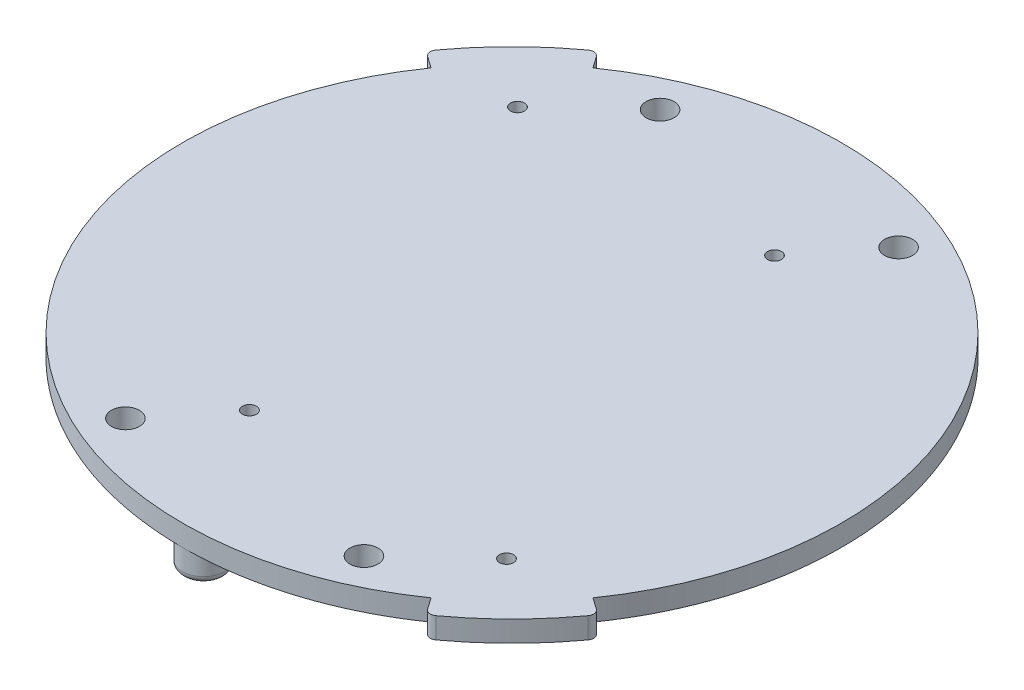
ISO-10303-21;
HEADER;
FILE_DESCRIPTION(('STEP AP214'),'2;1');
FILE_NAME('part.step','',(''),(''),'','','');
FILE_SCHEMA(('AUTOMOTIVE_DESIGN { 1 0 10303 214 1 1 1 1 }'));
ENDSEC;
DATA;
#1=APPLICATION_CONTEXT('core data for automotive mechanical design processes');
#2=APPLICATION_PROTOCOL_DEFINITION('international standard','automotive_design',2000,#1);
#3=PRODUCT_CONTEXT('',#1,'mechanical');
#4=PRODUCT('Part','Part','',(#3));
#5=PRODUCT_RELATED_PRODUCT_CATEGORY('part','',(#4));
#6=PRODUCT_DEFINITION_FORMATION('','',#4);
#7=PRODUCT_DEFINITION_CONTEXT('part definition',#1,'design');
#8=PRODUCT_DEFINITION('design','',#6,#7);
#9=PRODUCT_DEFINITION_SHAPE('','',#8);
#10=(LENGTH_UNIT() NAMED_UNIT(*) SI_UNIT(.MILLI.,.METRE.));
#11=(NAMED_UNIT(*) PLANE_ANGLE_UNIT() SI_UNIT($,.RADIAN.));
#12=(NAMED_UNIT(*) SI_UNIT($,.STERADIAN.) SOLID_ANGLE_UNIT());
#13=UNCERTAINTY_MEASURE_WITH_UNIT(LENGTH_MEASURE(1.E-05),#10,'distance_accuracy_value','');
#14=(GEOMETRIC_REPRESENTATION_CONTEXT(3) GLOBAL_UNCERTAINTY_ASSIGNED_CONTEXT((#13)) GLOBAL_UNIT_ASSIGNED_CONTEXT((#10,
#11,#12)) REPRESENTATION_CONTEXT('',''));
#15=CARTESIAN_POINT('',(0.,0.,0.));
#16=DIRECTION('',(0.,0.,1.));
#17=DIRECTION('',(1.,0.,0.));
#18=AXIS2_PLACEMENT_3D('',#15,#16,#17);
#19=CARTESIAN_POINT('',(0.,1.5,0.));
#20=DIRECTION('',(0.,-1.,0.));
#21=DIRECTION('',(0.,0.,-1.));
#22=AXIS2_PLACEMENT_3D('',#19,#20,#21);
#23=CYLINDRICAL_SURFACE('',#22,47.);
#24=DIRECTION('',(0.,1.,0.));
#25=VECTOR('',#24,1.);
#26=CARTESIAN_POINT('',(-38.5001460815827,-21.2982964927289,-26.958092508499));
#27=LINE('',#26,#25);
#28=CARTESIAN_POINT('',(-38.5001460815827,-1.50000000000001,-26.958092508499));
#29=VERTEX_POINT('',#28);
#30=CARTESIAN_POINT('',(-38.5001460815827,1.5,-26.958092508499));
#31=VERTEX_POINT('',#30);
#32=EDGE_CURVE('E446',#29,#31,#27,.T.);
#33=ORIENTED_EDGE('',*,*,#32,.F.);
#34=CARTESIAN_POINT('',(0.,-1.5,0.));
#35=DIRECTION('',(0.,1.,0.));
#36=DIRECTION('',(0.,0.,1.));
#37=AXIS2_PLACEMENT_3D('',#34,#35,#36);
#38=CIRCLE('',#37,47.);
#39=CARTESIAN_POINT('',(-46.7520897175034,-1.5,-4.82100684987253));
#40=VERTEX_POINT('',#39);
#41=EDGE_CURVE('E495',#29,#40,#38,.T.);
#42=ORIENTED_EDGE('',*,*,#41,.T.);
#43=DIRECTION('',(0.,1.,0.));
#44=VECTOR('',#43,1.);
#45=CARTESIAN_POINT('',(-46.7520897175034,-9.5,-4.82100684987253));
#46=LINE('',#45,#44);
#47=CARTESIAN_POINT('',(-46.7520897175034,-1.56421989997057,-4.82100684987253));
#48=VERTEX_POINT('',#47);
#49=EDGE_CURVE('E884',#48,#40,#46,.T.);
#50=ORIENTED_EDGE('',*,*,#49,.F.);
#51=CARTESIAN_POINT('',(-43.5620347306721,-9.5,-17.6450879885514));
#52=CARTESIAN_POINT('',(-43.5620041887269,-9.33411921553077,-17.645141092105));
#53=CARTESIAN_POINT('',(-43.5650463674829,-9.16826638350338,-17.6376524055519));
#54=CARTESIAN_POINT('',(-43.5770475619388,-8.83822102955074,-17.6079922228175));
#55=CARTESIAN_POINT('',(-43.5860019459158,-8.67402731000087,-17.5858322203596));
#56=CARTESIAN_POINT('',(-43.6094953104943,-8.35007845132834,-17.5274880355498));
#57=CARTESIAN_POINT('',(-43.6239842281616,-8.19029690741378,-17.4914295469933));
#58=CARTESIAN_POINT('',(-43.6581519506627,-7.87490456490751,-17.4059729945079));
#59=CARTESIAN_POINT('',(-43.6778314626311,-7.7192943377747,-17.356573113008));
#60=CARTESIAN_POINT('',(-43.7218200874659,-7.41378567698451,-17.2454630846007));
#61=CARTESIAN_POINT('',(-43.7461144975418,-7.26387087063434,-17.1837920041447));
#62=CARTESIAN_POINT('',(-43.7988226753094,-6.97000064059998,-17.0489989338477));
#63=CARTESIAN_POINT('',(-43.8272381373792,-6.826047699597,-16.9758722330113));
#64=CARTESIAN_POINT('',(-43.9178878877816,-6.40365243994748,-16.7405921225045));
#65=CARTESIAN_POINT('',(-43.9854702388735,-6.13504210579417,-16.5626762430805));
#66=CARTESIAN_POINT('',(-44.159613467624,-5.52349880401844,-16.0938824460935));
#67=CARTESIAN_POINT('',(-44.270863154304,-5.19463554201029,-15.7864618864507));
#68=CARTESIAN_POINT('',(-44.4437605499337,-4.74363401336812,-15.2899780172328));
#69=CARTESIAN_POINT('',(-44.5024763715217,-4.60019164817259,-15.1183472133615));
#70=CARTESIAN_POINT('',(-44.6209370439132,-4.32671000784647,-14.7650458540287));
#71=CARTESIAN_POINT('',(-44.6806817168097,-4.19666844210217,-14.5833770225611));
#72=CARTESIAN_POINT('',(-44.8325278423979,-3.88265038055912,-14.1115056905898));
#73=CARTESIAN_POINT('',(-44.9247223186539,-3.70735638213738,-13.8155554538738));
#74=CARTESIAN_POINT('',(-45.1069342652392,-3.3838915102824,-13.2085229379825));
#75=CARTESIAN_POINT('',(-45.1969504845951,-3.2357359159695,-12.8974322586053));
#76=CARTESIAN_POINT('',(-45.3731167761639,-2.96345656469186,-12.2633093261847));
#77=CARTESIAN_POINT('',(-45.4592604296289,-2.83937165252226,-11.9402587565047));
#78=CARTESIAN_POINT('',(-45.626266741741,-2.61268712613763,-11.2853034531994));
#79=CARTESIAN_POINT('',(-45.7071274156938,-2.51009555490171,-10.9533954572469));
#80=CARTESIAN_POINT('',(-45.8544625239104,-2.33366578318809,-10.3181004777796));
#81=CARTESIAN_POINT('',(-45.9215562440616,-2.25794016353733,-10.0153745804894));
#82=CARTESIAN_POINT('',(-46.0502806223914,-2.12004685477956,-9.40577943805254));
#83=CARTESIAN_POINT('',(-46.1119121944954,-2.05787689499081,-9.0989108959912));
#84=CARTESIAN_POINT('',(-46.2294330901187,-1.94552833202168,-8.48164515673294));
#85=CARTESIAN_POINT('',(-46.2853176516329,-1.89535962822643,-8.17124526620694));
#86=CARTESIAN_POINT('',(-46.3910516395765,-1.8057191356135,-7.54786969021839));
#87=CARTESIAN_POINT('',(-46.4409003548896,-1.76624860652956,-7.23489370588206));
#88=CARTESIAN_POINT('',(-46.581137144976,-1.66199558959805,-6.29289461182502));
#89=CARTESIAN_POINT('',(-46.6622006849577,-1.61138543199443,-5.66087988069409));
#90=CARTESIAN_POINT('',(-46.7986022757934,-1.53940433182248,-4.39289104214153));
#91=CARTESIAN_POINT('',(-46.8539529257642,-1.51801905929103,-3.75691902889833));
#92=CARTESIAN_POINT('',(-46.9070569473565,-1.50503664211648,-2.95874247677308));
#93=CARTESIAN_POINT('',(-46.9169547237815,-1.50312047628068,-2.79740924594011));
#94=CARTESIAN_POINT('',(-46.9350711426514,-1.50060296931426,-2.47489962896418));
#95=CARTESIAN_POINT('',(-46.943292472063,-1.49999950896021,-2.3137234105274));
#96=CARTESIAN_POINT('',(-46.9506840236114,-1.5,-2.15250312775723));
#97=B_SPLINE_CURVE_WITH_KNOTS('',3,(#51,#52,#53,#54,#55,#56,#57,#58,#59,#60,#61,#62,#63,#64,#65,
#66,#67,#68,#69,#70,#71,#72,#73,#74,#75,#76,#77,#78,#79,#80,#81,#82,#83,#84,#85,#86,#87,#88,#89,
#90,#91,#92,#93,#94,#95,#96),.UNSPECIFIED.,.F.,.F.,(4,2,2,2,2,2,2,2,2,2,2,2,2,2,2,2,2,2,2,2,2,2,
4),(0.,0.49740151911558,0.994413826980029,1.48703294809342,1.97971921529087,2.47086136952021,
2.96220603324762,3.94607265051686,5.32917035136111,6.02250801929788,6.71572697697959,
7.78237882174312,8.84962936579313,9.91858814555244,10.9879462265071,11.9451124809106,
12.9021182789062,13.85991077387,14.8178160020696,16.7338721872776,18.6489885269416,
19.133925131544,19.6180782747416),.UNSPECIFIED.);
#98=CARTESIAN_POINT('',(-46.9506840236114,-1.5,-2.15250312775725));
#99=VERTEX_POINT('',#98);
#100=EDGE_CURVE('E731',#48,#99,#97,.T.);
#101=ORIENTED_EDGE('',*,*,#100,.T.);
#102=CARTESIAN_POINT('',(-36.7626637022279,-1.5,29.2832128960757));
#103=VERTEX_POINT('',#102);
#104=EDGE_CURVE('E473',#99,#103,#38,.T.);
#105=ORIENTED_EDGE('',*,*,#104,.T.);
#106=CARTESIAN_POINT('',(-36.7626637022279,-1.5,29.2832128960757));
#107=CARTESIAN_POINT('',(-36.6236327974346,-1.50000236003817,29.4577554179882));
#108=CARTESIAN_POINT('',(-36.4833562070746,-1.50115389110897,29.6313097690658));
#109=CARTESIAN_POINT('',(-36.2004160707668,-1.50603438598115,29.9763176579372));
#110=CARTESIAN_POINT('',(-36.0577534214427,-1.50976240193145,30.1477719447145));
#111=CARTESIAN_POINT('',(-35.7700420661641,-1.52007459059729,30.4885850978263));
#112=CARTESIAN_POINT('',(-35.624993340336,-1.5266587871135,30.6579439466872));
#113=CARTESIAN_POINT('',(-35.3325243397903,-1.54299011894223,30.9945554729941));
#114=CARTESIAN_POINT('',(-35.1851032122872,-1.55273841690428,31.1618073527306));
#115=CARTESIAN_POINT('',(-35.0365559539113,-1.56421989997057,31.3279387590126));
#116=B_SPLINE_CURVE_WITH_KNOTS('',3,(#106,#107,#108,#109,#110,#111,#112,#113,#114,#115),
.UNSPECIFIED.,.F.,.F.,(4,2,2,2,4),(0.,0.669437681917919,1.3386292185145,2.00782633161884,
2.67726962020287),.UNSPECIFIED.);
#117=CARTESIAN_POINT('',(-35.0365559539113,-1.56421989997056,31.3279387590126));
#118=VERTEX_POINT('',#117);
#119=EDGE_CURVE('E738',#103,#118,#116,.T.);
#120=ORIENTED_EDGE('',*,*,#119,.T.);
#121=DIRECTION('',(0.,1.,0.));
#122=VECTOR('',#121,1.);
#123=CARTESIAN_POINT('',(-35.0365559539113,-9.5,31.3279387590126));
#124=LINE('',#123,#122);
#125=CARTESIAN_POINT('',(-35.0365559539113,-1.5,31.3279387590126));
#126=VERTEX_POINT('',#125);
#127=EDGE_CURVE('E894',#118,#126,#124,.T.);
#128=ORIENTED_EDGE('',*,*,#127,.T.);
#129=CARTESIAN_POINT('',(0.,-1.5,47.));
#130=VERTEX_POINT('',#129);
#131=EDGE_CURVE('E483',#126,#130,#38,.T.);
#132=ORIENTED_EDGE('',*,*,#131,.T.);
#133=CARTESIAN_POINT('',(26.9580925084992,-1.5,38.5001460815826));
#134=VERTEX_POINT('',#133);
#135=EDGE_CURVE('E490',#130,#134,#38,.T.);
#136=ORIENTED_EDGE('',*,*,#135,.T.);
#137=DIRECTION('',(0.,1.,0.));
#138=VECTOR('',#137,1.);
#139=CARTESIAN_POINT('',(26.9580925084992,-21.2982964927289,38.5001460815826));
#140=LINE('',#139,#138);
#141=CARTESIAN_POINT('',(26.9580925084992,1.5,38.5001460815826));
#142=VERTEX_POINT('',#141);
#143=EDGE_CURVE('E1106',#134,#142,#140,.T.);
#144=ORIENTED_EDGE('',*,*,#143,.T.);
#145=CARTESIAN_POINT('',(0.,1.5,0.));
#146=DIRECTION('',(0.,1.,0.));
#147=DIRECTION('',(0.,0.,1.));
#148=AXIS2_PLACEMENT_3D('',#145,#146,#147);
#149=CIRCLE('',#148,47.);
#150=EDGE_CURVE('E466',#31,#142,#149,.T.);
#151=ORIENTED_EDGE('',*,*,#150,.F.);
#152=EDGE_LOOP('',(#33,#42,#50,#101,#105,#120,#128,#132,#136,#144,#151));
#153=FACE_BOUND('',#152,.T.);
#154=ADVANCED_FACE('F39',(#153),#23,.T.);
#155=CARTESIAN_POINT('',(0.,-1.5,0.));
#156=DIRECTION('',(0.,1.,0.));
#157=DIRECTION('',(0.,0.,1.));
#158=AXIS2_PLACEMENT_3D('',#155,#156,#157);
#159=PLANE('',#158);
#160=CARTESIAN_POINT('',(-17.009259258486,-1.5,-38.1280421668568));
#161=DIRECTION('',(0.,1.,0.));
#162=DIRECTION('',(0.,0.,1.));
#163=AXIS2_PLACEMENT_3D('',#160,#161,#162);
#164=CIRCLE('',#163,2.);
#165=CARTESIAN_POINT('',(-17.009259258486,-1.5,-36.1280421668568));
#166=VERTEX_POINT('',#165);
#167=EDGE_CURVE('E866',#166,#166,#164,.T.);
#168=ORIENTED_EDGE('',*,*,#167,.T.);
#169=EDGE_LOOP('',(#168));
#170=FACE_BOUND('',#169,.T.);
#171=CARTESIAN_POINT('',(-17.0092592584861,-1.5,38.1280421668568));
#172=DIRECTION('',(0.,1.,0.));
#173=DIRECTION('',(0.,0.,-1.));
#174=AXIS2_PLACEMENT_3D('',#171,#172,#173);
#175=CIRCLE('',#174,2.);
#176=CARTESIAN_POINT('',(-17.0092592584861,-1.5,36.1280421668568));
#177=VERTEX_POINT('',#176);
#178=EDGE_CURVE('E872',#177,#177,#175,.T.);
#179=ORIENTED_EDGE('',*,*,#178,.T.);
#180=EDGE_LOOP('',(#179));
#181=FACE_BOUND('',#180,.T.);
#182=CARTESIAN_POINT('',(17.009259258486,-1.5,-38.1280421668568));
#183=DIRECTION('',(0.,1.,0.));
#184=DIRECTION('',(0.,0.,-1.));
#185=AXIS2_PLACEMENT_3D('',#182,#183,#184);
#186=CIRCLE('',#185,2.);
#187=CARTESIAN_POINT('',(17.009259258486,-1.5,-40.1280421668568));
#188=VERTEX_POINT('',#187);
#189=EDGE_CURVE('E860',#188,#188,#186,.T.);
#190=ORIENTED_EDGE('',*,*,#189,.T.);
#191=EDGE_LOOP('',(#190));
#192=FACE_BOUND('',#191,.T.);
#193=CARTESIAN_POINT('',(17.0092592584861,-1.5,38.1280421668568));
#194=DIRECTION('',(0.,1.,0.));
#195=DIRECTION('',(0.,0.,1.));
#196=AXIS2_PLACEMENT_3D('',#193,#194,#195);
#197=CIRCLE('',#196,2.);
#198=CARTESIAN_POINT('',(17.0092592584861,-1.5,40.1280421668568));
#199=VERTEX_POINT('',#198);
#200=EDGE_CURVE('E854',#199,#199,#197,.T.);
#201=ORIENTED_EDGE('',*,*,#200,.T.);
#202=EDGE_LOOP('',(#201));
#203=FACE_BOUND('',#202,.T.);
#204=CARTESIAN_POINT('',(-9.16666666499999,-1.5,28.2842712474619));
#205=DIRECTION('',(0.,1.,0.));
#206=DIRECTION('',(0.,0.,1.));
#207=AXIS2_PLACEMENT_3D('',#204,#205,#206);
#208=CIRCLE('',#207,1.);
#209=CARTESIAN_POINT('',(-9.16666666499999,-1.5,29.2842712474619));
#210=VERTEX_POINT('',#209);
#211=EDGE_CURVE('E842',#210,#210,#208,.T.);
#212=ORIENTED_EDGE('',*,*,#211,.T.);
#213=EDGE_LOOP('',(#212));
#214=FACE_BOUND('',#213,.T.);
#215=CARTESIAN_POINT('',(9.16666666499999,-1.5,-28.2842712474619));
#216=DIRECTION('',(0.,1.,0.));
#217=DIRECTION('',(0.,0.,1.));
#218=AXIS2_PLACEMENT_3D('',#215,#216,#217);
#219=CIRCLE('',#218,1.);
#220=CARTESIAN_POINT('',(9.16666666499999,-1.5,-27.2842712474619));
#221=VERTEX_POINT('',#220);
#222=EDGE_CURVE('E835',#221,#221,#219,.T.);
#223=ORIENTED_EDGE('',*,*,#222,.T.);
#224=EDGE_LOOP('',(#223));
#225=FACE_BOUND('',#224,.T.);
#226=CARTESIAN_POINT('',(27.4999999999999,-1.5,28.2842712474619));
#227=DIRECTION('',(0.,1.,0.));
#228=DIRECTION('',(0.,0.,1.));
#229=AXIS2_PLACEMENT_3D('',#226,#227,#228);
#230=CIRCLE('',#229,0.999999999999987);
#231=CARTESIAN_POINT('',(27.4999999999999,-1.5,29.2842712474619));
#232=VERTEX_POINT('',#231);
#233=EDGE_CURVE('E498',#232,#232,#230,.T.);
#234=ORIENTED_EDGE('',*,*,#233,.T.);
#235=EDGE_LOOP('',(#234));
#236=FACE_BOUND('',#235,.T.);
#237=CARTESIAN_POINT('',(-27.4999999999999,-1.5,-28.2842712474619));
#238=DIRECTION('',(0.,1.,0.));
#239=DIRECTION('',(0.,0.,1.));
#240=AXIS2_PLACEMENT_3D('',#237,#238,#239);
#241=CIRCLE('',#240,1.);
#242=CARTESIAN_POINT('',(-27.4999999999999,-1.5,-27.2842712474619));
#243=VERTEX_POINT('',#242);
#244=EDGE_CURVE('E848',#243,#243,#241,.T.);
#245=ORIENTED_EDGE('',*,*,#244,.T.);
#246=EDGE_LOOP('',(#245));
#247=FACE_BOUND('',#246,.T.);
#248=DIRECTION('',(0.819152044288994,0.,0.573576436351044));
#249=VECTOR('',#248,1.);
#250=CARTESIAN_POINT('',(0.,-1.5,0.));
#251=LINE('',#250,#249);
#252=CARTESIAN_POINT('',(-40.1300906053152,-1.5,-28.0993919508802));
#253=VERTEX_POINT('',#252);
#254=EDGE_CURVE('E457',#253,#29,#251,.T.);
#255=ORIENTED_EDGE('',*,*,#254,.F.);
#256=CARTESIAN_POINT('',(-39.5565141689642,-1.5,-28.9185439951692));
#257=DIRECTION('',(0.,1.,0.));
#258=DIRECTION('',(0.,0.,1.));
#259=AXIS2_PLACEMENT_3D('',#256,#257,#258);
#260=CIRCLE('',#259,1.);
#261=CARTESIAN_POINT('',(-40.3637899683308,-1.5,-29.5087183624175));
#262=VERTEX_POINT('',#261);
#263=EDGE_CURVE('E524',#253,#262,#260,.F.);
#264=ORIENTED_EDGE('',*,*,#263,.T.);
#265=CARTESIAN_POINT('',(0.,-1.5,0.));
#266=DIRECTION('',(0.,1.,0.));
#267=DIRECTION('',(0.,0.,1.));
#268=AXIS2_PLACEMENT_3D('',#265,#266,#267);
#269=CIRCLE('',#268,50.);
#270=CARTESIAN_POINT('',(-29.5087183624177,-1.5,-40.3637899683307));
#271=VERTEX_POINT('',#270);
#272=EDGE_CURVE('E1117',#271,#262,#269,.T.);
#273=ORIENTED_EDGE('',*,*,#272,.F.);
#274=CARTESIAN_POINT('',(-28.9185439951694,-1.5,-39.556514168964));
#275=DIRECTION('',(0.,1.,0.));
#276=DIRECTION('',(0.,0.,1.));
#277=AXIS2_PLACEMENT_3D('',#274,#275,#276);
#278=CIRCLE('',#277,1.);
#279=CARTESIAN_POINT('',(-28.0993919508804,-1.5,-40.1300906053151));
#280=VERTEX_POINT('',#279);
#281=EDGE_CURVE('E57',#271,#280,#278,.F.);
#282=ORIENTED_EDGE('',*,*,#281,.T.);
#283=DIRECTION('',(0.573576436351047,0.,0.819152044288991));
#284=VECTOR('',#283,1.);
#285=CARTESIAN_POINT('',(0.,-1.5,0.));
#286=LINE('',#285,#284);
#287=CARTESIAN_POINT('',(-26.9580925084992,-1.5,-38.5001460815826));
#288=VERTEX_POINT('',#287);
#289=EDGE_CURVE('E1122',#280,#288,#286,.T.);
#290=ORIENTED_EDGE('',*,*,#289,.T.);
#291=CARTESIAN_POINT('',(0.,-1.5,-47.));
#292=VERTEX_POINT('',#291);
#293=EDGE_CURVE('E455',#292,#288,#38,.T.);
#294=ORIENTED_EDGE('',*,*,#293,.F.);
#295=CARTESIAN_POINT('',(0.,-1.5,-44.));
#296=DIRECTION('',(0.,-1.,0.));
#297=DIRECTION('',(0.,0.,1.));
#298=AXIS2_PLACEMENT_3D('',#295,#296,#297);
#299=CIRCLE('',#298,3.);
#300=EDGE_CURVE('E1096',#292,#292,#299,.T.);
#301=ORIENTED_EDGE('',*,*,#300,.F.);
#302=CARTESIAN_POINT('',(38.5001460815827,-1.5,26.9580925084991));
#303=VERTEX_POINT('',#302);
#304=EDGE_CURVE('E494',#303,#292,#38,.T.);
#305=ORIENTED_EDGE('',*,*,#304,.F.);
#306=DIRECTION('',(-0.819152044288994,0.,-0.573576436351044));
#307=VECTOR('',#306,1.);
#308=CARTESIAN_POINT('',(0.,-1.5,0.));
#309=LINE('',#308,#307);
#310=CARTESIAN_POINT('',(40.1300906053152,-1.5,28.0993919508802));
#311=VERTEX_POINT('',#310);
#312=EDGE_CURVE('E1109',#311,#303,#309,.T.);
#313=ORIENTED_EDGE('',*,*,#312,.F.);
#314=CARTESIAN_POINT('',(39.5565141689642,-1.5,28.9185439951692));
#315=DIRECTION('',(0.,1.,0.));
#316=DIRECTION('',(0.,0.,1.));
#317=AXIS2_PLACEMENT_3D('',#314,#315,#316);
#318=CIRCLE('',#317,1.);
#319=CARTESIAN_POINT('',(40.3637899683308,-1.5,29.5087183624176));
#320=VERTEX_POINT('',#319);
#321=EDGE_CURVE('E520',#311,#320,#318,.F.);
#322=ORIENTED_EDGE('',*,*,#321,.T.);
#323=CARTESIAN_POINT('',(0.,-1.5,0.));
#324=DIRECTION('',(0.,1.,0.));
#325=DIRECTION('',(0.,0.,1.));
#326=AXIS2_PLACEMENT_3D('',#323,#324,#325);
#327=CIRCLE('',#326,50.);
#328=CARTESIAN_POINT('',(29.5087183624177,-1.5,40.3637899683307));
#329=VERTEX_POINT('',#328);
#330=EDGE_CURVE('E1101',#320,#329,#327,.F.);
#331=ORIENTED_EDGE('',*,*,#330,.T.);
#332=CARTESIAN_POINT('',(28.9185439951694,-1.5,39.5565141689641));
#333=DIRECTION('',(0.,1.,0.));
#334=DIRECTION('',(0.,0.,1.));
#335=AXIS2_PLACEMENT_3D('',#332,#333,#334);
#336=CIRCLE('',#335,1.);
#337=CARTESIAN_POINT('',(28.0993919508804,-1.5,40.1300906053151));
#338=VERTEX_POINT('',#337);
#339=EDGE_CURVE('E64',#329,#338,#336,.F.);
#340=ORIENTED_EDGE('',*,*,#339,.T.);
#341=DIRECTION('',(-0.573576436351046,0.,-0.819152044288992));
#342=VECTOR('',#341,1.);
#343=CARTESIAN_POINT('',(0.,-1.5,0.));
#344=LINE('',#343,#342);
#345=EDGE_CURVE('E1103',#338,#134,#344,.T.);
#346=ORIENTED_EDGE('',*,*,#345,.T.);
#347=ORIENTED_EDGE('',*,*,#135,.F.);
#348=CARTESIAN_POINT('',(0.,-1.5,44.));
#349=DIRECTION('',(0.,-1.,0.));
#350=DIRECTION('',(0.,0.,-1.));
#351=AXIS2_PLACEMENT_3D('',#348,#349,#350);
#352=CIRCLE('',#351,3.);
#353=EDGE_CURVE('E1093',#130,#130,#352,.T.);
#354=ORIENTED_EDGE('',*,*,#353,.F.);
#355=ORIENTED_EDGE('',*,*,#131,.F.);
#356=DIRECTION('',(-0.951288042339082,0.,0.308303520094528));
#357=VECTOR('',#356,1.);
#358=CARTESIAN_POINT('',(5.85776688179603,-1.5,18.0744728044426));
#359=LINE('',#358,#357);
#360=CARTESIAN_POINT('',(1.10132667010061,-1.5,19.6159904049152));
#361=VERTEX_POINT('',#360);
#362=EDGE_CURVE('E916',#361,#126,#359,.T.);
#363=ORIENTED_EDGE('',*,*,#362,.F.);
#364=DIRECTION('',(-0.308303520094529,0.,-0.951288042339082));
#365=VECTOR('',#364,1.);
#366=CARTESIAN_POINT('',(-4.75644021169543,-1.5,1.54151760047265));
#367=LINE('',#366,#365);
#368=CARTESIAN_POINT('',(0.176416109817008,-1.5,16.7621262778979));
#369=VERTEX_POINT('',#368);
#370=EDGE_CURVE('E1884',#361,#369,#367,.T.);
#371=ORIENTED_EDGE('',*,*,#370,.T.);
#372=DIRECTION('',(-0.951288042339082,0.,0.308303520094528));
#373=VECTOR('',#372,1.);
#374=CARTESIAN_POINT('',(4.93285632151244,-1.5,15.2206086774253));
#375=LINE('',#374,#373);
#376=CARTESIAN_POINT('',(-7.43388822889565,-1.5,19.2285544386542));
#377=VERTEX_POINT('',#376);
#378=EDGE_CURVE('E1882',#369,#377,#375,.T.);
#379=ORIENTED_EDGE('',*,*,#378,.T.);
#380=DIRECTION('',(-0.308303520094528,0.,-0.951288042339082));
#381=VECTOR('',#380,1.);
#382=CARTESIAN_POINT('',(-12.3667445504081,-1.5,4.00794576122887));
#383=LINE('',#382,#381);
#384=CARTESIAN_POINT('',(-9.90031638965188,-1.5,11.6182500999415));
#385=VERTEX_POINT('',#384);
#386=EDGE_CURVE('E1879',#377,#385,#383,.T.);
#387=ORIENTED_EDGE('',*,*,#386,.T.);
#388=DIRECTION('',(-0.951288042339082,0.,0.308303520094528));
#389=VECTOR('',#388,1.);
#390=CARTESIAN_POINT('',(14.8331727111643,-1.5,3.60235857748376));
#391=LINE('',#390,#389);
#392=CARTESIAN_POINT('',(13.8818846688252,-1.5,3.91066209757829));
#393=VERTEX_POINT('',#392);
#394=EDGE_CURVE('E708',#393,#385,#391,.T.);
#395=ORIENTED_EDGE('',*,*,#394,.F.);
#396=CARTESIAN_POINT('',(13.5735811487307,-1.5,2.9593740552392));
#397=DIRECTION('',(0.,1.,0.));
#398=DIRECTION('',(0.,0.,1.));
#399=AXIS2_PLACEMENT_3D('',#396,#397,#398);
#400=CIRCLE('',#399,1.);
#401=CARTESIAN_POINT('',(14.5248691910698,-1.5,2.65107053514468));
#402=VERTEX_POINT('',#401);
#403=EDGE_CURVE('E1041',#393,#402,#400,.T.);
#404=ORIENTED_EDGE('',*,*,#403,.T.);
#405=DIRECTION('',(0.308303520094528,0.,0.951288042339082));
#406=VECTOR('',#405,1.);
#407=CARTESIAN_POINT('',(9.90031638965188,-1.5,-11.6182500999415));
#408=LINE('',#407,#406);
#409=CARTESIAN_POINT('',(10.2086199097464,-1.5,-10.6669620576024));
#410=VERTEX_POINT('',#409);
#411=EDGE_CURVE('E686',#410,#402,#408,.T.);
#412=ORIENTED_EDGE('',*,*,#411,.F.);
#413=CARTESIAN_POINT('',(9.25733186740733,-1.5,-10.3586585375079));
#414=DIRECTION('',(0.,1.,0.));
#415=DIRECTION('',(0.,0.,1.));
#416=AXIS2_PLACEMENT_3D('',#413,#414,#415);
#417=CIRCLE('',#416,1.);
#418=CARTESIAN_POINT('',(8.94902834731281,-1.5,-11.309946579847));
#419=VERTEX_POINT('',#418);
#420=EDGE_CURVE('E1039',#410,#419,#417,.T.);
#421=ORIENTED_EDGE('',*,*,#420,.T.);
#422=DIRECTION('',(0.951288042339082,0.,-0.308303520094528));
#423=VECTOR('',#422,1.);
#424=CARTESIAN_POINT('',(-14.8331727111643,-1.5,-3.60235857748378));
#425=LINE('',#424,#423);
#426=CARTESIAN_POINT('',(-14.8331727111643,-1.5,-3.60235857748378));
#427=VERTEX_POINT('',#426);
#428=EDGE_CURVE('E699',#427,#419,#425,.T.);
#429=ORIENTED_EDGE('',*,*,#428,.F.);
#430=CARTESIAN_POINT('',(-17.2996008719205,-1.5,-11.2126629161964));
#431=VERTEX_POINT('',#430);
#432=EDGE_CURVE('E1878',#427,#431,#383,.T.);
#433=ORIENTED_EDGE('',*,*,#432,.T.);
#434=DIRECTION('',(-0.951288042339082,0.,0.308303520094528));
#435=VECTOR('',#434,1.);
#436=CARTESIAN_POINT('',(-4.93285632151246,-1.5,-15.2206086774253));
#437=LINE('',#436,#435);
#438=CARTESIAN_POINT('',(-9.68929653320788,-1.5,-13.6790910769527));
#439=VERTEX_POINT('',#438);
#440=EDGE_CURVE('E1865',#439,#431,#437,.T.);
#441=ORIENTED_EDGE('',*,*,#440,.F.);
#442=DIRECTION('',(0.308303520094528,0.,0.951288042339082));
#443=VECTOR('',#442,1.);
#444=CARTESIAN_POINT('',(-4.75644021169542,-1.5,1.54151760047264));
#445=LINE('',#444,#443);
#446=CARTESIAN_POINT('',(-10.6142070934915,-1.5,-16.5329552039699));
#447=VERTEX_POINT('',#446);
#448=EDGE_CURVE('E1862',#447,#439,#445,.T.);
#449=ORIENTED_EDGE('',*,*,#448,.F.);
#450=DIRECTION('',(-0.951288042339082,0.,0.308303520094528));
#451=VECTOR('',#450,1.);
#452=CARTESIAN_POINT('',(-5.85776688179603,-1.5,-18.0744728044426));
#453=LINE('',#452,#451);
#454=EDGE_CURVE('E1860',#447,#40,#453,.T.);
#455=ORIENTED_EDGE('',*,*,#454,.T.);
#456=ORIENTED_EDGE('',*,*,#41,.F.);
#457=EDGE_LOOP('',(#255,#264,#273,#282,#290,#294,#301,#305,#313,#322,#331,#340,#346,#347,#354,
#355,#363,#371,#379,#387,#395,#404,#412,#421,#429,#433,#441,#449,#455,#456));
#458=FACE_BOUND('',#457,.T.);
#459=ADVANCED_FACE('F559',(#170,#181,#192,#203,#214,#225,#236,#247,#458),#159,.F.);
#460=CARTESIAN_POINT('',(0.,-9.5,0.));
#461=DIRECTION('',(0.,-1.,0.));
#462=DIRECTION('',(0.,0.,-1.));
#463=AXIS2_PLACEMENT_3D('',#460,#461,#462);
#464=PLANE('',#463);
#465=DIRECTION('',(0.308303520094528,0.,0.951288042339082));
#466=VECTOR('',#465,1.);
#467=CARTESIAN_POINT('',(-34.246369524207,-9.5,11.098926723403));
#468=LINE('',#467,#466);
#469=CARTESIAN_POINT('',(-39.1792258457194,-9.5,-4.12168195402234));
#470=VERTEX_POINT('',#469);
#471=CARTESIAN_POINT('',(-29.3135132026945,-9.5,26.3195354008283));
#472=VERTEX_POINT('',#471);
#473=EDGE_CURVE('E1928',#470,#472,#468,.T.);
#474=ORIENTED_EDGE('',*,*,#473,.F.);
#475=DIRECTION('',(-0.951288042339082,0.,0.308303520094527));
#476=VECTOR('',#475,1.);
#477=CARTESIAN_POINT('',(-39.1792258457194,-9.5,-4.12168195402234));
#478=LINE('',#477,#476);
#479=CARTESIAN_POINT('',(-36.3253617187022,-9.5,-5.04659251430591));
#480=VERTEX_POINT('',#479);
#481=EDGE_CURVE('E1083',#480,#470,#478,.T.);
#482=ORIENTED_EDGE('',*,*,#481,.F.);
#483=DIRECTION('',(-0.308303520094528,0.,-0.951288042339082));
#484=VECTOR('',#483,1.);
#485=CARTESIAN_POINT('',(-31.3925053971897,-9.5,10.1740161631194));
#486=LINE('',#485,#484);
#487=CARTESIAN_POINT('',(-26.4596490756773,-9.5,25.3946248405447));
#488=VERTEX_POINT('',#487);
#489=EDGE_CURVE('E1929',#488,#480,#486,.T.);
#490=ORIENTED_EDGE('',*,*,#489,.F.);
#491=DIRECTION('',(0.951288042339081,0.,-0.308303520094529));
#492=VECTOR('',#491,1.);
#493=CARTESIAN_POINT('',(-29.3135132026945,-9.5,26.3195354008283));
#494=LINE('',#493,#492);
#495=EDGE_CURVE('E1047',#472,#488,#494,.T.);
#496=ORIENTED_EDGE('',*,*,#495,.F.);
#497=EDGE_LOOP('',(#474,#482,#490,#496));
#498=FACE_BOUND('',#497,.T.);
#499=ADVANCED_FACE('F565',(#498),#464,.T.);
#500=DIRECTION('',(0.308303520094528,0.,0.951288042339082));
#501=VECTOR('',#500,1.);
#502=CARTESIAN_POINT('',(-15.2206086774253,-9.5,4.93285632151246));
#503=LINE('',#502,#501);
#504=CARTESIAN_POINT('',(-20.1534649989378,-9.5,-10.2877523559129));
#505=VERTEX_POINT('',#504);
#506=CARTESIAN_POINT('',(-10.2877523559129,-9.5,20.1534649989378));
#507=VERTEX_POINT('',#506);
#508=EDGE_CURVE('E910',#505,#507,#503,.T.);
#509=ORIENTED_EDGE('',*,*,#508,.F.);
#510=CARTESIAN_POINT('',(-17.2996008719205,-9.5,-11.2126629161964));
#511=VERTEX_POINT('',#510);
#512=EDGE_CURVE('E1080',#511,#505,#478,.T.);
#513=ORIENTED_EDGE('',*,*,#512,.F.);
#514=DIRECTION('',(-0.308303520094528,0.,-0.951288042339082));
#515=VECTOR('',#514,1.);
#516=CARTESIAN_POINT('',(-12.3667445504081,-9.5,4.00794576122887));
#517=LINE('',#516,#515);
#518=CARTESIAN_POINT('',(-7.43388822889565,-9.5,19.2285544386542));
#519=VERTEX_POINT('',#518);
#520=EDGE_CURVE('E1925',#519,#511,#517,.T.);
#521=ORIENTED_EDGE('',*,*,#520,.F.);
#522=EDGE_CURVE('E503',#507,#519,#494,.T.);
#523=ORIENTED_EDGE('',*,*,#522,.F.);
#524=EDGE_LOOP('',(#509,#513,#521,#523));
#525=FACE_BOUND('',#524,.T.);
#526=ADVANCED_FACE('F587',(#525),#464,.T.);
#527=CARTESIAN_POINT('',(-12.3667445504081,-9.5,4.00794576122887));
#528=DIRECTION('',(0.951288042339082,0.,-0.308303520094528));
#529=DIRECTION('',(-0.308303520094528,0.,-0.951288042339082));
#530=AXIS2_PLACEMENT_3D('',#527,#528,#529);
#531=PLANE('',#530);
#532=DIRECTION('',(0.308303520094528,0.,0.951288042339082));
#533=VECTOR('',#532,1.);
#534=CARTESIAN_POINT('',(-20.9158222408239,-3.5,-22.3707195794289));
#535=LINE('',#534,#533);
#536=CARTESIAN_POINT('',(-14.8331727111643,-3.5,-3.60235857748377));
#537=VERTEX_POINT('',#536);
#538=CARTESIAN_POINT('',(-9.90031638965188,-3.5,11.6182500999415));
#539=VERTEX_POINT('',#538);
#540=EDGE_CURVE('E656',#537,#539,#535,.T.);
#541=ORIENTED_EDGE('',*,*,#540,.T.);
#542=DIRECTION('',(0.,1.,0.));
#543=VECTOR('',#542,1.);
#544=CARTESIAN_POINT('',(-9.90031638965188,-6.5,11.6182500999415));
#545=LINE('',#544,#543);
#546=EDGE_CURVE('E713',#539,#385,#545,.T.);
#547=ORIENTED_EDGE('',*,*,#546,.T.);
#548=ORIENTED_EDGE('',*,*,#386,.F.);
#549=DIRECTION('',(0.,1.,0.));
#550=VECTOR('',#549,1.);
#551=CARTESIAN_POINT('',(-7.43388822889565,-9.5,19.2285544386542));
#552=LINE('',#551,#550);
#553=EDGE_CURVE('E891',#519,#377,#552,.T.);
#554=ORIENTED_EDGE('',*,*,#553,.F.);
#555=ORIENTED_EDGE('',*,*,#520,.T.);
#556=DIRECTION('',(0.,1.,0.));
#557=VECTOR('',#556,1.);
#558=CARTESIAN_POINT('',(-17.2996008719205,-9.5,-11.2126629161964));
#559=LINE('',#558,#557);
#560=EDGE_CURVE('E878',#511,#431,#559,.T.);
#561=ORIENTED_EDGE('',*,*,#560,.T.);
#562=ORIENTED_EDGE('',*,*,#432,.F.);
#563=DIRECTION('',(0.,1.,0.));
#564=VECTOR('',#563,1.);
#565=CARTESIAN_POINT('',(-14.8331727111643,-6.5,-3.60235857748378));
#566=LINE('',#565,#564);
#567=EDGE_CURVE('E705',#537,#427,#566,.T.);
#568=ORIENTED_EDGE('',*,*,#567,.F.);
#569=EDGE_LOOP('',(#541,#547,#548,#554,#555,#561,#562,#568));
#570=FACE_BOUND('',#569,.T.);
#571=ADVANCED_FACE('F581',(#570),#531,.T.);
#572=ORIENTED_EDGE('',*,*,#104,.F.);
#573=DIRECTION('',(0.308303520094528,0.,0.951288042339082));
#574=VECTOR('',#573,1.);
#575=CARTESIAN_POINT('',(-60.1084996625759,-1.5,-42.7516914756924));
#576=LINE('',#575,#574);
#577=CARTESIAN_POINT('',(-46.7895301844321,-1.5,-1.65525379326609));
#578=VERTEX_POINT('',#577);
#579=EDGE_CURVE('E721',#99,#578,#576,.T.);
#580=ORIENTED_EDGE('',*,*,#579,.T.);
#581=DIRECTION('',(-0.951288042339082,0.,0.308303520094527));
#582=VECTOR('',#581,1.);
#583=CARTESIAN_POINT('',(-4.93285632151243,-1.5,-15.2206086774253));
#584=LINE('',#583,#582);
#585=CARTESIAN_POINT('',(-39.1792258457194,-1.5,-4.12168195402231));
#586=VERTEX_POINT('',#585);
#587=EDGE_CURVE('E906',#586,#578,#584,.T.);
#588=ORIENTED_EDGE('',*,*,#587,.F.);
#589=DIRECTION('',(0.308303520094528,0.,0.951288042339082));
#590=VECTOR('',#589,1.);
#591=CARTESIAN_POINT('',(-34.246369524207,-1.5,11.098926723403));
#592=LINE('',#591,#590);
#593=CARTESIAN_POINT('',(-29.3135132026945,-1.5,26.3195354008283));
#594=VERTEX_POINT('',#593);
#595=EDGE_CURVE('E903',#586,#594,#592,.T.);
#596=ORIENTED_EDGE('',*,*,#595,.T.);
#597=DIRECTION('',(-0.951288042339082,0.,0.308303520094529));
#598=VECTOR('',#597,1.);
#599=CARTESIAN_POINT('',(4.93285632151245,-1.5,15.2206086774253));
#600=LINE('',#599,#598);
#601=CARTESIAN_POINT('',(-36.9238175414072,-1.5,28.7859635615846));
#602=VERTEX_POINT('',#601);
#603=EDGE_CURVE('E913',#594,#602,#600,.T.);
#604=ORIENTED_EDGE('',*,*,#603,.T.);
#605=EDGE_CURVE('E718',#602,#103,#576,.T.);
#606=ORIENTED_EDGE('',*,*,#605,.T.);
#607=EDGE_LOOP('',(#572,#580,#588,#596,#604,#606));
#608=FACE_BOUND('',#607,.T.);
#609=ADVANCED_FACE('F568',(#608),#159,.F.);
#610=ORIENTED_EDGE('',*,*,#293,.T.);
#611=DIRECTION('',(0.,1.,0.));
#612=VECTOR('',#611,1.);
#613=CARTESIAN_POINT('',(-26.9580925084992,-21.2982964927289,-38.5001460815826));
#614=LINE('',#613,#612);
#615=CARTESIAN_POINT('',(-26.9580925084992,1.5,-38.5001460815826));
#616=VERTEX_POINT('',#615);
#617=EDGE_CURVE('E439',#288,#616,#614,.T.);
#618=ORIENTED_EDGE('',*,*,#617,.T.);
#619=CARTESIAN_POINT('',(38.5001460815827,1.5,26.9580925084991));
#620=VERTEX_POINT('',#619);
#621=EDGE_CURVE('E453',#620,#616,#149,.T.);
#622=ORIENTED_EDGE('',*,*,#621,.F.);
#623=DIRECTION('',(0.,1.,0.));
#624=VECTOR('',#623,1.);
#625=CARTESIAN_POINT('',(38.5001460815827,-21.2982964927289,26.9580925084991));
#626=LINE('',#625,#624);
#627=EDGE_CURVE('E1104',#303,#620,#626,.T.);
#628=ORIENTED_EDGE('',*,*,#627,.F.);
#629=ORIENTED_EDGE('',*,*,#304,.T.);
#630=EDGE_LOOP('',(#610,#618,#622,#628,#629));
#631=FACE_BOUND('',#630,.T.);
#632=ADVANCED_FACE('F451',(#631),#23,.T.);
#633=CARTESIAN_POINT('',(0.,1.5,0.));
#634=DIRECTION('',(0.,1.,0.));
#635=DIRECTION('',(0.,0.,1.));
#636=AXIS2_PLACEMENT_3D('',#633,#634,#635);
#637=PLANE('',#636);
#638=CARTESIAN_POINT('',(-17.0092592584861,1.5,38.1280421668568));
#639=DIRECTION('',(0.,1.,0.));
#640=DIRECTION('',(0.,0.,-1.));
#641=AXIS2_PLACEMENT_3D('',#638,#639,#640);
#642=CIRCLE('',#641,2.);
#643=CARTESIAN_POINT('',(-17.0092592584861,1.5,36.1280421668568));
#644=VERTEX_POINT('',#643);
#645=EDGE_CURVE('E875',#644,#644,#642,.T.);
#646=ORIENTED_EDGE('',*,*,#645,.F.);
#647=EDGE_LOOP('',(#646));
#648=FACE_BOUND('',#647,.T.);
#649=CARTESIAN_POINT('',(-17.009259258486,1.5,-38.1280421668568));
#650=DIRECTION('',(0.,1.,0.));
#651=DIRECTION('',(0.,0.,1.));
#652=AXIS2_PLACEMENT_3D('',#649,#650,#651);
#653=CIRCLE('',#652,2.);
#654=CARTESIAN_POINT('',(-17.009259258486,1.5,-36.1280421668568));
#655=VERTEX_POINT('',#654);
#656=EDGE_CURVE('E869',#655,#655,#653,.T.);
#657=ORIENTED_EDGE('',*,*,#656,.F.);
#658=EDGE_LOOP('',(#657));
#659=FACE_BOUND('',#658,.T.);
#660=CARTESIAN_POINT('',(17.009259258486,1.5,-38.1280421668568));
#661=DIRECTION('',(0.,1.,0.));
#662=DIRECTION('',(0.,0.,-1.));
#663=AXIS2_PLACEMENT_3D('',#660,#661,#662);
#664=CIRCLE('',#663,2.);
#665=CARTESIAN_POINT('',(17.009259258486,1.5,-40.1280421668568));
#666=VERTEX_POINT('',#665);
#667=EDGE_CURVE('E863',#666,#666,#664,.T.);
#668=ORIENTED_EDGE('',*,*,#667,.F.);
#669=EDGE_LOOP('',(#668));
#670=FACE_BOUND('',#669,.T.);
#671=CARTESIAN_POINT('',(17.0092592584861,1.5,38.1280421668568));
#672=DIRECTION('',(0.,1.,0.));
#673=DIRECTION('',(0.,0.,1.));
#674=AXIS2_PLACEMENT_3D('',#671,#672,#673);
#675=CIRCLE('',#674,2.);
#676=CARTESIAN_POINT('',(17.0092592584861,1.5,40.1280421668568));
#677=VERTEX_POINT('',#676);
#678=EDGE_CURVE('E857',#677,#677,#675,.T.);
#679=ORIENTED_EDGE('',*,*,#678,.F.);
#680=EDGE_LOOP('',(#679));
#681=FACE_BOUND('',#680,.T.);
#682=CARTESIAN_POINT('',(-27.4999999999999,1.5,-28.2842712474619));
#683=DIRECTION('',(0.,1.,0.));
#684=DIRECTION('',(0.,0.,1.));
#685=AXIS2_PLACEMENT_3D('',#682,#683,#684);
#686=CIRCLE('',#685,1.);
#687=CARTESIAN_POINT('',(-27.4999999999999,1.5,-27.2842712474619));
#688=VERTEX_POINT('',#687);
#689=EDGE_CURVE('E851',#688,#688,#686,.T.);
#690=ORIENTED_EDGE('',*,*,#689,.F.);
#691=EDGE_LOOP('',(#690));
#692=FACE_BOUND('',#691,.T.);
#693=CARTESIAN_POINT('',(-9.16666666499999,1.5,28.2842712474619));
#694=DIRECTION('',(0.,1.,0.));
#695=DIRECTION('',(0.,0.,1.));
#696=AXIS2_PLACEMENT_3D('',#693,#694,#695);
#697=CIRCLE('',#696,1.);
#698=CARTESIAN_POINT('',(-9.16666666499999,1.5,29.2842712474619));
#699=VERTEX_POINT('',#698);
#700=EDGE_CURVE('E845',#699,#699,#697,.T.);
#701=ORIENTED_EDGE('',*,*,#700,.F.);
#702=EDGE_LOOP('',(#701));
#703=FACE_BOUND('',#702,.T.);
#704=CARTESIAN_POINT('',(9.16666666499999,1.5,-28.2842712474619));
#705=DIRECTION('',(0.,1.,0.));
#706=DIRECTION('',(0.,0.,1.));
#707=AXIS2_PLACEMENT_3D('',#704,#705,#706);
#708=CIRCLE('',#707,1.);
#709=CARTESIAN_POINT('',(9.16666666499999,1.5,-27.2842712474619));
#710=VERTEX_POINT('',#709);
#711=EDGE_CURVE('E837',#710,#710,#708,.T.);
#712=ORIENTED_EDGE('',*,*,#711,.F.);
#713=EDGE_LOOP('',(#712));
#714=FACE_BOUND('',#713,.T.);
#715=CARTESIAN_POINT('',(27.4999999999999,1.5,28.2842712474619));
#716=DIRECTION('',(0.,1.,0.));
#717=DIRECTION('',(0.,0.,1.));
#718=AXIS2_PLACEMENT_3D('',#715,#716,#717);
#719=CIRCLE('',#718,0.999999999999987);
#720=CARTESIAN_POINT('',(27.4999999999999,1.5,29.2842712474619));
#721=VERTEX_POINT('',#720);
#722=EDGE_CURVE('E476',#721,#721,#719,.T.);
#723=ORIENTED_EDGE('',*,*,#722,.F.);
#724=EDGE_LOOP('',(#723));
#725=FACE_BOUND('',#724,.T.);
#726=CARTESIAN_POINT('',(0.,1.5,0.));
#727=DIRECTION('',(0.,1.,0.));
#728=DIRECTION('',(0.,0.,1.));
#729=AXIS2_PLACEMENT_3D('',#726,#727,#728);
#730=CIRCLE('',#729,50.);
#731=CARTESIAN_POINT('',(-40.3637899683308,1.5,-29.5087183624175));
#732=VERTEX_POINT('',#731);
#733=CARTESIAN_POINT('',(-29.5087183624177,1.5,-40.3637899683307));
#734=VERTEX_POINT('',#733);
#735=EDGE_CURVE('E1129',#732,#734,#730,.F.);
#736=ORIENTED_EDGE('',*,*,#735,.F.);
#737=CARTESIAN_POINT('',(-39.5565141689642,1.5,-28.9185439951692));
#738=DIRECTION('',(0.,1.,0.));
#739=DIRECTION('',(0.,0.,1.));
#740=AXIS2_PLACEMENT_3D('',#737,#738,#739);
#741=CIRCLE('',#740,1.);
#742=CARTESIAN_POINT('',(-40.1300906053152,1.5,-28.0993919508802));
#743=VERTEX_POINT('',#742);
#744=EDGE_CURVE('E514',#732,#743,#741,.T.);
#745=ORIENTED_EDGE('',*,*,#744,.T.);
#746=DIRECTION('',(-0.819152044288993,0.,-0.573576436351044));
#747=VECTOR('',#746,1.);
#748=CARTESIAN_POINT('',(0.,1.5,0.));
#749=LINE('',#748,#747);
#750=EDGE_CURVE('E447',#31,#743,#749,.T.);
#751=ORIENTED_EDGE('',*,*,#750,.F.);
#752=ORIENTED_EDGE('',*,*,#150,.T.);
#753=DIRECTION('',(0.573576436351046,0.,0.819152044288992));
#754=VECTOR('',#753,1.);
#755=CARTESIAN_POINT('',(0.,1.5,0.));
#756=LINE('',#755,#754);
#757=CARTESIAN_POINT('',(28.0993919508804,1.5,40.1300906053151));
#758=VERTEX_POINT('',#757);
#759=EDGE_CURVE('E1114',#142,#758,#756,.T.);
#760=ORIENTED_EDGE('',*,*,#759,.T.);
#761=CARTESIAN_POINT('',(28.9185439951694,1.5,39.5565141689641));
#762=DIRECTION('',(0.,1.,0.));
#763=DIRECTION('',(0.,0.,1.));
#764=AXIS2_PLACEMENT_3D('',#761,#762,#763);
#765=CIRCLE('',#764,1.);
#766=CARTESIAN_POINT('',(29.5087183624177,1.5,40.3637899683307));
#767=VERTEX_POINT('',#766);
#768=EDGE_CURVE('E509',#758,#767,#765,.T.);
#769=ORIENTED_EDGE('',*,*,#768,.T.);
#770=CARTESIAN_POINT('',(0.,1.5,0.));
#771=DIRECTION('',(0.,1.,0.));
#772=DIRECTION('',(0.,0.,1.));
#773=AXIS2_PLACEMENT_3D('',#770,#771,#772);
#774=CIRCLE('',#773,50.);
#775=CARTESIAN_POINT('',(40.3637899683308,1.5,29.5087183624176));
#776=VERTEX_POINT('',#775);
#777=EDGE_CURVE('E1111',#767,#776,#774,.T.);
#778=ORIENTED_EDGE('',*,*,#777,.T.);
#779=CARTESIAN_POINT('',(39.5565141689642,1.5,28.9185439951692));
#780=DIRECTION('',(0.,1.,0.));
#781=DIRECTION('',(0.,0.,1.));
#782=AXIS2_PLACEMENT_3D('',#779,#780,#781);
#783=CIRCLE('',#782,1.);
#784=CARTESIAN_POINT('',(40.1300906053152,1.5,28.0993919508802));
#785=VERTEX_POINT('',#784);
#786=EDGE_CURVE('E507',#776,#785,#783,.T.);
#787=ORIENTED_EDGE('',*,*,#786,.T.);
#788=DIRECTION('',(0.819152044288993,0.,0.573576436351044));
#789=VECTOR('',#788,1.);
#790=CARTESIAN_POINT('',(0.,1.5,0.));
#791=LINE('',#790,#789);
#792=EDGE_CURVE('E462',#620,#785,#791,.T.);
#793=ORIENTED_EDGE('',*,*,#792,.F.);
#794=ORIENTED_EDGE('',*,*,#621,.T.);
#795=DIRECTION('',(-0.573576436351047,0.,-0.819152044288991));
#796=VECTOR('',#795,1.);
#797=CARTESIAN_POINT('',(0.,1.5,0.));
#798=LINE('',#797,#796);
#799=CARTESIAN_POINT('',(-28.0993919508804,1.5,-40.1300906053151));
#800=VERTEX_POINT('',#799);
#801=EDGE_CURVE('E436',#616,#800,#798,.T.);
#802=ORIENTED_EDGE('',*,*,#801,.T.);
#803=CARTESIAN_POINT('',(-28.9185439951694,1.5,-39.556514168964));
#804=DIRECTION('',(0.,1.,0.));
#805=DIRECTION('',(0.,0.,1.));
#806=AXIS2_PLACEMENT_3D('',#803,#804,#805);
#807=CIRCLE('',#806,1.);
#808=EDGE_CURVE('E511',#800,#734,#807,.T.);
#809=ORIENTED_EDGE('',*,*,#808,.T.);
#810=EDGE_LOOP('',(#736,#745,#751,#752,#760,#769,#778,#787,#793,#794,#802,#809));
#811=FACE_BOUND('',#810,.T.);
#812=ADVANCED_FACE('F460',(#648,#659,#670,#681,#692,#703,#714,#725,#811),#637,.T.);
#813=CARTESIAN_POINT('',(27.4999999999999,-1.5,28.2842712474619));
#814=DIRECTION('',(0.,1.,0.));
#815=DIRECTION('',(0.,0.,1.));
#816=AXIS2_PLACEMENT_3D('',#813,#814,#815);
#817=CYLINDRICAL_SURFACE('',#816,0.999999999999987);
#818=ORIENTED_EDGE('',*,*,#233,.F.);
#819=EDGE_LOOP('',(#818));
#820=FACE_BOUND('',#819,.T.);
#821=ORIENTED_EDGE('',*,*,#722,.T.);
#822=EDGE_LOOP('',(#821));
#823=FACE_BOUND('',#822,.T.);
#824=ADVANCED_FACE('F578',(#820,#823),#817,.F.);
#825=CARTESIAN_POINT('',(9.16666666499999,-1.5,-28.2842712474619));
#826=DIRECTION('',(0.,1.,0.));
#827=DIRECTION('',(0.,0.,1.));
#828=AXIS2_PLACEMENT_3D('',#825,#826,#827);
#829=CYLINDRICAL_SURFACE('',#828,1.);
#830=ORIENTED_EDGE('',*,*,#222,.F.);
#831=EDGE_LOOP('',(#830));
#832=FACE_BOUND('',#831,.T.);
#833=ORIENTED_EDGE('',*,*,#711,.T.);
#834=EDGE_LOOP('',(#833));
#835=FACE_BOUND('',#834,.T.);
#836=ADVANCED_FACE('F820',(#832,#835),#829,.F.);
#837=CARTESIAN_POINT('',(-9.16666666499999,-1.5,28.2842712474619));
#838=DIRECTION('',(0.,1.,0.));
#839=DIRECTION('',(0.,0.,1.));
#840=AXIS2_PLACEMENT_3D('',#837,#838,#839);
#841=CYLINDRICAL_SURFACE('',#840,1.);
#842=ORIENTED_EDGE('',*,*,#211,.F.);
#843=EDGE_LOOP('',(#842));
#844=FACE_BOUND('',#843,.T.);
#845=ORIENTED_EDGE('',*,*,#700,.T.);
#846=EDGE_LOOP('',(#845));
#847=FACE_BOUND('',#846,.T.);
#848=ADVANCED_FACE('F816',(#844,#847),#841,.F.);
#849=CARTESIAN_POINT('',(-27.4999999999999,-1.5,-28.2842712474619));
#850=DIRECTION('',(0.,1.,0.));
#851=DIRECTION('',(0.,0.,1.));
#852=AXIS2_PLACEMENT_3D('',#849,#850,#851);
#853=CYLINDRICAL_SURFACE('',#852,1.);
#854=ORIENTED_EDGE('',*,*,#244,.F.);
#855=EDGE_LOOP('',(#854));
#856=FACE_BOUND('',#855,.T.);
#857=ORIENTED_EDGE('',*,*,#689,.T.);
#858=EDGE_LOOP('',(#857));
#859=FACE_BOUND('',#858,.T.);
#860=ADVANCED_FACE('F812',(#856,#859),#853,.F.);
#861=CARTESIAN_POINT('',(17.0092592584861,-1.5,38.1280421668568));
#862=DIRECTION('',(0.,1.,0.));
#863=DIRECTION('',(0.,0.,1.));
#864=AXIS2_PLACEMENT_3D('',#861,#862,#863);
#865=CYLINDRICAL_SURFACE('',#864,2.);
#866=ORIENTED_EDGE('',*,*,#200,.F.);
#867=EDGE_LOOP('',(#866));
#868=FACE_BOUND('',#867,.T.);
#869=ORIENTED_EDGE('',*,*,#678,.T.);
#870=EDGE_LOOP('',(#869));
#871=FACE_BOUND('',#870,.T.);
#872=ADVANCED_FACE('F808',(#868,#871),#865,.F.);
#873=CARTESIAN_POINT('',(17.009259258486,-1.5,-38.1280421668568));
#874=DIRECTION('',(0.,1.,0.));
#875=DIRECTION('',(0.,0.,1.));
#876=AXIS2_PLACEMENT_3D('',#873,#874,#875);
#877=CYLINDRICAL_SURFACE('',#876,2.);
#878=ORIENTED_EDGE('',*,*,#189,.F.);
#879=EDGE_LOOP('',(#878));
#880=FACE_BOUND('',#879,.T.);
#881=ORIENTED_EDGE('',*,*,#667,.T.);
#882=EDGE_LOOP('',(#881));
#883=FACE_BOUND('',#882,.T.);
#884=ADVANCED_FACE('F804',(#880,#883),#877,.F.);
#885=CARTESIAN_POINT('',(-17.009259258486,-1.5,-38.1280421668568));
#886=DIRECTION('',(0.,1.,0.));
#887=DIRECTION('',(0.,0.,1.));
#888=AXIS2_PLACEMENT_3D('',#885,#886,#887);
#889=CYLINDRICAL_SURFACE('',#888,2.);
#890=ORIENTED_EDGE('',*,*,#167,.F.);
#891=EDGE_LOOP('',(#890));
#892=FACE_BOUND('',#891,.T.);
#893=ORIENTED_EDGE('',*,*,#656,.T.);
#894=EDGE_LOOP('',(#893));
#895=FACE_BOUND('',#894,.T.);
#896=ADVANCED_FACE('F800',(#892,#895),#889,.F.);
#897=CARTESIAN_POINT('',(-17.0092592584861,-1.5,38.1280421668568));
#898=DIRECTION('',(0.,1.,0.));
#899=DIRECTION('',(0.,0.,1.));
#900=AXIS2_PLACEMENT_3D('',#897,#898,#899);
#901=CYLINDRICAL_SURFACE('',#900,2.);
#902=ORIENTED_EDGE('',*,*,#178,.F.);
#903=EDGE_LOOP('',(#902));
#904=FACE_BOUND('',#903,.T.);
#905=ORIENTED_EDGE('',*,*,#645,.T.);
#906=EDGE_LOOP('',(#905));
#907=FACE_BOUND('',#906,.T.);
#908=ADVANCED_FACE('F785',(#904,#907),#901,.F.);
#909=CARTESIAN_POINT('',(-5.85776688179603,-9.5,-18.0744728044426));
#910=DIRECTION('',(-0.308303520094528,0.,-0.951288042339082));
#911=DIRECTION('',(-0.951288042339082,0.,0.308303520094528));
#912=AXIS2_PLACEMENT_3D('',#909,#910,#911);
#913=PLANE('',#912);
#914=CARTESIAN_POINT('',(-47.7144407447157,-9.5,-4.50911792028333));
#915=DIRECTION('',(-0.308303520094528,0.,-0.951288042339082));
#916=DIRECTION('',(-0.951288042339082,0.,0.308303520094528));
#917=AXIS2_PLACEMENT_3D('',#914,#915,#916);
#918=CIRCLE('',#917,8.);
#919=CARTESIAN_POINT('',(-40.104136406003,-9.5,-6.97554608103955));
#920=VERTEX_POINT('',#919);
#921=EDGE_CURVE('E728',#48,#920,#918,.T.);
#922=ORIENTED_EDGE('',*,*,#921,.F.);
#923=ORIENTED_EDGE('',*,*,#49,.T.);
#924=ORIENTED_EDGE('',*,*,#454,.F.);
#925=CARTESIAN_POINT('',(-10.6142070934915,-9.5,-16.5329552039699));
#926=DIRECTION('',(-0.308303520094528,0.,-0.951288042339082));
#927=DIRECTION('',(-0.951288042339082,0.,0.308303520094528));
#928=AXIS2_PLACEMENT_3D('',#925,#926,#927);
#929=CIRCLE('',#928,8.);
#930=CARTESIAN_POINT('',(-18.2245114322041,-9.5,-14.0665270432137));
#931=VERTEX_POINT('',#930);
#932=EDGE_CURVE('E1935',#931,#447,#929,.T.);
#933=ORIENTED_EDGE('',*,*,#932,.F.);
#934=DIRECTION('',(0.,1.,0.));
#935=VECTOR('',#934,1.);
#936=CARTESIAN_POINT('',(-18.2245114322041,-12.5,-14.0665270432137));
#937=LINE('',#936,#935);
#938=CARTESIAN_POINT('',(-18.2245114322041,-12.5,-14.0665270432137));
#939=VERTEX_POINT('',#938);
#940=EDGE_CURVE('E1077',#939,#931,#937,.T.);
#941=ORIENTED_EDGE('',*,*,#940,.F.);
#942=DIRECTION('',(0.951288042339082,0.,-0.308303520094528));
#943=VECTOR('',#942,1.);
#944=CARTESIAN_POINT('',(-18.2245114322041,-12.5,-14.0665270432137));
#945=LINE('',#944,#943);
#946=CARTESIAN_POINT('',(-40.104136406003,-12.5,-6.97554608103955));
#947=VERTEX_POINT('',#946);
#948=EDGE_CURVE('E1079',#947,#939,#945,.T.);
#949=ORIENTED_EDGE('',*,*,#948,.F.);
#950=DIRECTION('',(0.,1.,0.));
#951=VECTOR('',#950,1.);
#952=CARTESIAN_POINT('',(-40.104136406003,-12.5,-6.97554608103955));
#953=LINE('',#952,#951);
#954=EDGE_CURVE('E1074',#947,#920,#953,.T.);
#955=ORIENTED_EDGE('',*,*,#954,.T.);
#956=EDGE_LOOP('',(#922,#923,#924,#933,#941,#949,#955));
#957=FACE_BOUND('',#956,.T.);
#958=ADVANCED_FACE('F782',(#957),#913,.T.);
#959=CARTESIAN_POINT('',(-4.93285632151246,-9.5,-15.2206086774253));
#960=DIRECTION('',(-0.308303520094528,0.,-0.951288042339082));
#961=DIRECTION('',(-0.951288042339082,0.,0.308303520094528));
#962=AXIS2_PLACEMENT_3D('',#959,#960,#961);
#963=PLANE('',#962);
#964=ORIENTED_EDGE('',*,*,#560,.F.);
#965=CARTESIAN_POINT('',(-9.68929653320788,-9.5,-13.6790910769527));
#966=DIRECTION('',(-0.308303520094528,0.,-0.951288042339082));
#967=DIRECTION('',(-0.951288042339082,0.,0.308303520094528));
#968=AXIS2_PLACEMENT_3D('',#965,#966,#967);
#969=CIRCLE('',#968,8.);
#970=EDGE_CURVE('E1932',#511,#439,#969,.T.);
#971=ORIENTED_EDGE('',*,*,#970,.T.);
#972=ORIENTED_EDGE('',*,*,#440,.T.);
#973=EDGE_LOOP('',(#964,#971,#972));
#974=FACE_BOUND('',#973,.T.);
#975=ADVANCED_FACE('F777',(#974),#963,.F.);
#976=CARTESIAN_POINT('',(4.93285632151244,-9.5,15.2206086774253));
#977=DIRECTION('',(-0.308303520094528,0.,-0.951288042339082));
#978=DIRECTION('',(-0.951288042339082,0.,0.308303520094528));
#979=AXIS2_PLACEMENT_3D('',#976,#977,#978);
#980=PLANE('',#979);
#981=CARTESIAN_POINT('',(0.176416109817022,-9.5,16.762126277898));
#982=DIRECTION('',(-0.308303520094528,0.,-0.951288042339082));
#983=DIRECTION('',(-0.951288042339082,0.,0.308303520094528));
#984=AXIS2_PLACEMENT_3D('',#981,#982,#983);
#985=CIRCLE('',#984,8.);
#986=EDGE_CURVE('E1917',#519,#369,#985,.T.);
#987=ORIENTED_EDGE('',*,*,#986,.F.);
#988=ORIENTED_EDGE('',*,*,#553,.T.);
#989=ORIENTED_EDGE('',*,*,#378,.F.);
#990=EDGE_LOOP('',(#987,#988,#989));
#991=FACE_BOUND('',#990,.T.);
#992=ADVANCED_FACE('F774',(#991),#980,.T.);
#993=CARTESIAN_POINT('',(5.85776688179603,-9.5,18.0744728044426));
#994=DIRECTION('',(-0.308303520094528,0.,-0.951288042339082));
#995=DIRECTION('',(-0.951288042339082,0.,0.308303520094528));
#996=AXIS2_PLACEMENT_3D('',#993,#994,#995);
#997=PLANE('',#996);
#998=ORIENTED_EDGE('',*,*,#127,.F.);
#999=CARTESIAN_POINT('',(-35.9989069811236,-9.5,31.6398276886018));
#1000=DIRECTION('',(0.308303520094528,0.,0.951288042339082));
#1001=DIRECTION('',(0.951288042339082,0.,-0.308303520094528));
#1002=AXIS2_PLACEMENT_3D('',#999,#1000,#1001);
#1003=CIRCLE('',#1002,8.);
#1004=CARTESIAN_POINT('',(-28.3886026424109,-9.5,29.1733995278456));
#1005=VERTEX_POINT('',#1004);
#1006=EDGE_CURVE('E716',#1005,#118,#1003,.T.);
#1007=ORIENTED_EDGE('',*,*,#1006,.F.);
#1008=DIRECTION('',(0.,1.,0.));
#1009=VECTOR('',#1008,1.);
#1010=CARTESIAN_POINT('',(-28.3886026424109,-12.5,29.1733995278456));
#1011=LINE('',#1010,#1009);
#1012=CARTESIAN_POINT('',(-28.3886026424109,-12.5,29.1733995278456));
#1013=VERTEX_POINT('',#1012);
#1014=EDGE_CURVE('E1054',#1013,#1005,#1011,.T.);
#1015=ORIENTED_EDGE('',*,*,#1014,.F.);
#1016=DIRECTION('',(-0.951288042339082,0.,0.308303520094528));
#1017=VECTOR('',#1016,1.);
#1018=CARTESIAN_POINT('',(-6.50897766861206,-12.5,22.0824185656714));
#1019=LINE('',#1018,#1017);
#1020=CARTESIAN_POINT('',(-6.50897766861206,-12.5,22.0824185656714));
#1021=VERTEX_POINT('',#1020);
#1022=EDGE_CURVE('E1067',#1021,#1013,#1019,.T.);
#1023=ORIENTED_EDGE('',*,*,#1022,.F.);
#1024=DIRECTION('',(0.,1.,0.));
#1025=VECTOR('',#1024,1.);
#1026=CARTESIAN_POINT('',(-6.50897766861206,-12.5,22.0824185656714));
#1027=LINE('',#1026,#1025);
#1028=CARTESIAN_POINT('',(-6.50897766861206,-9.5,22.0824185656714));
#1029=VERTEX_POINT('',#1028);
#1030=EDGE_CURVE('E639',#1021,#1029,#1027,.T.);
#1031=ORIENTED_EDGE('',*,*,#1030,.T.);
#1032=CARTESIAN_POINT('',(1.10132667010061,-9.5,19.6159904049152));
#1033=DIRECTION('',(0.308303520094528,0.,0.951288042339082));
#1034=DIRECTION('',(0.951288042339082,0.,-0.308303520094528));
#1035=AXIS2_PLACEMENT_3D('',#1032,#1033,#1034);
#1036=CIRCLE('',#1035,8.);
#1037=EDGE_CURVE('E1893',#361,#1029,#1036,.T.);
#1038=ORIENTED_EDGE('',*,*,#1037,.F.);
#1039=ORIENTED_EDGE('',*,*,#362,.T.);
#1040=EDGE_LOOP('',(#998,#1007,#1015,#1023,#1031,#1038,#1039));
#1041=FACE_BOUND('',#1040,.T.);
#1042=ADVANCED_FACE('F770',(#1041),#997,.F.);
#1043=CARTESIAN_POINT('',(4.93285632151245,-9.5,15.2206086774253));
#1044=DIRECTION('',(-0.308303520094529,0.,-0.951288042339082));
#1045=DIRECTION('',(-0.951288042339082,0.,0.308303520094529));
#1046=AXIS2_PLACEMENT_3D('',#1043,#1044,#1045);
#1047=PLANE('',#1046);
#1048=CARTESIAN_POINT('',(-36.9238175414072,-9.5,28.7859635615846));
#1049=DIRECTION('',(-0.308303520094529,0.,-0.951288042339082));
#1050=DIRECTION('',(-0.951288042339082,0.,0.308303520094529));
#1051=AXIS2_PLACEMENT_3D('',#1048,#1049,#1050);
#1052=CIRCLE('',#1051,8.);
#1053=EDGE_CURVE('E725',#602,#472,#1052,.T.);
#1054=ORIENTED_EDGE('',*,*,#1053,.F.);
#1055=ORIENTED_EDGE('',*,*,#603,.F.);
#1056=DIRECTION('',(0.,1.,0.));
#1057=VECTOR('',#1056,1.);
#1058=CARTESIAN_POINT('',(-29.3135132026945,-9.5,26.3195354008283));
#1059=LINE('',#1058,#1057);
#1060=EDGE_CURVE('E895',#472,#594,#1059,.T.);
#1061=ORIENTED_EDGE('',*,*,#1060,.F.);
#1062=EDGE_LOOP('',(#1054,#1055,#1061));
#1063=FACE_BOUND('',#1062,.T.);
#1064=ADVANCED_FACE('F766',(#1063),#1047,.T.);
#1065=CARTESIAN_POINT('',(-34.246369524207,-9.5,11.098926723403));
#1066=DIRECTION('',(-0.951288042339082,0.,0.308303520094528));
#1067=DIRECTION('',(0.308303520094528,0.,0.951288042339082));
#1068=AXIS2_PLACEMENT_3D('',#1065,#1066,#1067);
#1069=PLANE('',#1068);
#1070=ORIENTED_EDGE('',*,*,#595,.F.);
#1071=DIRECTION('',(0.,1.,0.));
#1072=VECTOR('',#1071,1.);
#1073=CARTESIAN_POINT('',(-39.1792258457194,-9.5,-4.12168195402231));
#1074=LINE('',#1073,#1072);
#1075=EDGE_CURVE('E898',#470,#586,#1074,.T.);
#1076=ORIENTED_EDGE('',*,*,#1075,.F.);
#1077=ORIENTED_EDGE('',*,*,#473,.T.);
#1078=ORIENTED_EDGE('',*,*,#1060,.T.);
#1079=EDGE_LOOP('',(#1070,#1076,#1077,#1078));
#1080=FACE_BOUND('',#1079,.T.);
#1081=ADVANCED_FACE('F762',(#1080),#1069,.T.);
#1082=CARTESIAN_POINT('',(-4.93285632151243,-9.5,-15.2206086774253));
#1083=DIRECTION('',(-0.308303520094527,0.,-0.951288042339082));
#1084=DIRECTION('',(-0.951288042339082,0.,0.308303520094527));
#1085=AXIS2_PLACEMENT_3D('',#1082,#1083,#1084);
#1086=PLANE('',#1085);
#1087=ORIENTED_EDGE('',*,*,#587,.T.);
#1088=CARTESIAN_POINT('',(-46.7895301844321,-9.5,-1.65525379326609));
#1089=DIRECTION('',(-0.308303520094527,0.,-0.951288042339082));
#1090=DIRECTION('',(-0.951288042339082,0.,0.308303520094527));
#1091=AXIS2_PLACEMENT_3D('',#1088,#1089,#1090);
#1092=CIRCLE('',#1091,8.);
#1093=EDGE_CURVE('E722',#578,#470,#1092,.T.);
#1094=ORIENTED_EDGE('',*,*,#1093,.T.);
#1095=ORIENTED_EDGE('',*,*,#1075,.T.);
#1096=EDGE_LOOP('',(#1087,#1094,#1095));
#1097=FACE_BOUND('',#1096,.T.);
#1098=ADVANCED_FACE('F758',(#1097),#1086,.F.);
#1099=CARTESIAN_POINT('',(-15.2206086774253,-9.5,4.93285632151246));
#1100=DIRECTION('',(-0.951288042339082,0.,0.308303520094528));
#1101=DIRECTION('',(0.308303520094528,0.,0.951288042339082));
#1102=AXIS2_PLACEMENT_3D('',#1099,#1100,#1101);
#1103=PLANE('',#1102);
#1104=DIRECTION('',(0.308303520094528,0.,0.951288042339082));
#1105=VECTOR('',#1104,1.);
#1106=CARTESIAN_POINT('',(-15.2206086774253,-1.5,4.93285632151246));
#1107=LINE('',#1106,#1105);
#1108=CARTESIAN_POINT('',(-20.1534649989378,-1.5,-10.2877523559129));
#1109=VERTEX_POINT('',#1108);
#1110=CARTESIAN_POINT('',(-10.2877523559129,-1.5,20.1534649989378));
#1111=VERTEX_POINT('',#1110);
#1112=EDGE_CURVE('E1938',#1109,#1111,#1107,.T.);
#1113=ORIENTED_EDGE('',*,*,#1112,.F.);
#1114=DIRECTION('',(0.,1.,0.));
#1115=VECTOR('',#1114,1.);
#1116=CARTESIAN_POINT('',(-20.1534649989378,-9.5,-10.2877523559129));
#1117=LINE('',#1116,#1115);
#1118=EDGE_CURVE('E881',#505,#1109,#1117,.T.);
#1119=ORIENTED_EDGE('',*,*,#1118,.F.);
#1120=ORIENTED_EDGE('',*,*,#508,.T.);
#1121=DIRECTION('',(0.,1.,0.));
#1122=VECTOR('',#1121,1.);
#1123=CARTESIAN_POINT('',(-10.2877523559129,-9.5,20.1534649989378));
#1124=LINE('',#1123,#1122);
#1125=EDGE_CURVE('E1920',#507,#1111,#1124,.T.);
#1126=ORIENTED_EDGE('',*,*,#1125,.T.);
#1127=EDGE_LOOP('',(#1113,#1119,#1120,#1126));
#1128=FACE_BOUND('',#1127,.T.);
#1129=ADVANCED_FACE('F761',(#1128),#1103,.T.);
#1130=CARTESIAN_POINT('',(-4.93285632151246,-9.5,-15.2206086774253));
#1131=DIRECTION('',(-0.308303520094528,0.,-0.951288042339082));
#1132=DIRECTION('',(-0.951288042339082,0.,0.308303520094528));
#1133=AXIS2_PLACEMENT_3D('',#1130,#1131,#1132);
#1134=PLANE('',#1133);
#1135=DIRECTION('',(-0.951288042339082,0.,0.308303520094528));
#1136=VECTOR('',#1135,1.);
#1137=CARTESIAN_POINT('',(-4.93285632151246,-1.5,-15.2206086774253));
#1138=LINE('',#1137,#1136);
#1139=CARTESIAN_POINT('',(-36.3253617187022,-1.5,-5.04659251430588));
#1140=VERTEX_POINT('',#1139);
#1141=EDGE_CURVE('E1872',#1109,#1140,#1138,.T.);
#1142=ORIENTED_EDGE('',*,*,#1141,.T.);
#1143=DIRECTION('',(0.,1.,0.));
#1144=VECTOR('',#1143,1.);
#1145=CARTESIAN_POINT('',(-36.3253617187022,-9.5,-5.04659251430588));
#1146=LINE('',#1145,#1144);
#1147=EDGE_CURVE('E885',#480,#1140,#1146,.T.);
#1148=ORIENTED_EDGE('',*,*,#1147,.F.);
#1149=ORIENTED_EDGE('',*,*,#481,.T.);
#1150=DIRECTION('',(0.,1.,0.));
#1151=VECTOR('',#1150,1.);
#1152=CARTESIAN_POINT('',(-39.1792258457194,-12.5,-4.12168195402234));
#1153=LINE('',#1152,#1151);
#1154=CARTESIAN_POINT('',(-39.1792258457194,-12.5,-4.12168195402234));
#1155=VERTEX_POINT('',#1154);
#1156=EDGE_CURVE('E1072',#1155,#470,#1153,.T.);
#1157=ORIENTED_EDGE('',*,*,#1156,.F.);
#1158=DIRECTION('',(-0.951288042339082,0.,0.308303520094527));
#1159=VECTOR('',#1158,1.);
#1160=CARTESIAN_POINT('',(-39.1792258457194,-12.5,-4.12168195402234));
#1161=LINE('',#1160,#1159);
#1162=CARTESIAN_POINT('',(-17.2996008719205,-12.5,-11.2126629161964));
#1163=VERTEX_POINT('',#1162);
#1164=EDGE_CURVE('E1087',#1163,#1155,#1161,.T.);
#1165=ORIENTED_EDGE('',*,*,#1164,.F.);
#1166=DIRECTION('',(0.,1.,0.));
#1167=VECTOR('',#1166,1.);
#1168=CARTESIAN_POINT('',(-17.2996008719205,-12.5,-11.2126629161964));
#1169=LINE('',#1168,#1167);
#1170=EDGE_CURVE('E1051',#1163,#511,#1169,.T.);
#1171=ORIENTED_EDGE('',*,*,#1170,.T.);
#1172=ORIENTED_EDGE('',*,*,#512,.T.);
#1173=ORIENTED_EDGE('',*,*,#1118,.T.);
#1174=EDGE_LOOP('',(#1142,#1148,#1149,#1157,#1165,#1171,#1172,#1173));
#1175=FACE_BOUND('',#1174,.T.);
#1176=ADVANCED_FACE('F790',(#1175),#1134,.F.);
#1177=CARTESIAN_POINT('',(-31.3925053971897,-9.5,10.1740161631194));
#1178=DIRECTION('',(0.951288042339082,0.,-0.308303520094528));
#1179=DIRECTION('',(-0.308303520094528,0.,-0.951288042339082));
#1180=AXIS2_PLACEMENT_3D('',#1177,#1178,#1179);
#1181=PLANE('',#1180);
#1182=DIRECTION('',(-0.308303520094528,0.,-0.951288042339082));
#1183=VECTOR('',#1182,1.);
#1184=CARTESIAN_POINT('',(-31.3925053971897,-1.5,10.1740161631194));
#1185=LINE('',#1184,#1183);
#1186=CARTESIAN_POINT('',(-26.4596490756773,-1.5,25.3946248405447));
#1187=VERTEX_POINT('',#1186);
#1188=EDGE_CURVE('E1867',#1187,#1140,#1185,.T.);
#1189=ORIENTED_EDGE('',*,*,#1188,.F.);
#1190=DIRECTION('',(0.,1.,0.));
#1191=VECTOR('',#1190,1.);
#1192=CARTESIAN_POINT('',(-26.4596490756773,-9.5,25.3946248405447));
#1193=LINE('',#1192,#1191);
#1194=EDGE_CURVE('E888',#488,#1187,#1193,.T.);
#1195=ORIENTED_EDGE('',*,*,#1194,.F.);
#1196=ORIENTED_EDGE('',*,*,#489,.T.);
#1197=ORIENTED_EDGE('',*,*,#1147,.T.);
#1198=EDGE_LOOP('',(#1189,#1195,#1196,#1197));
#1199=FACE_BOUND('',#1198,.T.);
#1200=ADVANCED_FACE('F601',(#1199),#1181,.T.);
#1201=CARTESIAN_POINT('',(4.93285632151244,-9.5,15.2206086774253));
#1202=DIRECTION('',(-0.308303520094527,0.,-0.951288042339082));
#1203=DIRECTION('',(-0.951288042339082,0.,0.308303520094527));
#1204=AXIS2_PLACEMENT_3D('',#1201,#1202,#1203);
#1205=PLANE('',#1204);
#1206=DIRECTION('',(-0.951288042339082,0.,0.308303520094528));
#1207=VECTOR('',#1206,1.);
#1208=CARTESIAN_POINT('',(4.93285632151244,-1.5,15.2206086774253));
#1209=LINE('',#1208,#1207);
#1210=EDGE_CURVE('E1864',#1111,#1187,#1209,.T.);
#1211=ORIENTED_EDGE('',*,*,#1210,.F.);
#1212=ORIENTED_EDGE('',*,*,#1125,.F.);
#1213=ORIENTED_EDGE('',*,*,#522,.T.);
#1214=DIRECTION('',(0.,1.,0.));
#1215=VECTOR('',#1214,1.);
#1216=CARTESIAN_POINT('',(-7.43388822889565,-12.5,19.2285544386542));
#1217=LINE('',#1216,#1215);
#1218=CARTESIAN_POINT('',(-7.43388822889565,-12.5,19.2285544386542));
#1219=VERTEX_POINT('',#1218);
#1220=EDGE_CURVE('E1060',#1219,#519,#1217,.T.);
#1221=ORIENTED_EDGE('',*,*,#1220,.F.);
#1222=DIRECTION('',(0.951288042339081,0.,-0.308303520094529));
#1223=VECTOR('',#1222,1.);
#1224=CARTESIAN_POINT('',(-29.3135132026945,-12.5,26.3195354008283));
#1225=LINE('',#1224,#1223);
#1226=CARTESIAN_POINT('',(-29.3135132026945,-12.5,26.3195354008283));
#1227=VERTEX_POINT('',#1226);
#1228=EDGE_CURVE('E1063',#1227,#1219,#1225,.T.);
#1229=ORIENTED_EDGE('',*,*,#1228,.F.);
#1230=DIRECTION('',(0.,1.,0.));
#1231=VECTOR('',#1230,1.);
#1232=CARTESIAN_POINT('',(-29.3135132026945,-12.5,26.3195354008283));
#1233=LINE('',#1232,#1231);
#1234=EDGE_CURVE('E1057',#1227,#472,#1233,.T.);
#1235=ORIENTED_EDGE('',*,*,#1234,.T.);
#1236=ORIENTED_EDGE('',*,*,#495,.T.);
#1237=ORIENTED_EDGE('',*,*,#1194,.T.);
#1238=EDGE_LOOP('',(#1211,#1212,#1213,#1221,#1229,#1235,#1236,#1237));
#1239=FACE_BOUND('',#1238,.T.);
#1240=ADVANCED_FACE('F592',(#1239),#1205,.T.);
#1241=ORIENTED_EDGE('',*,*,#1141,.F.);
#1242=ORIENTED_EDGE('',*,*,#1112,.T.);
#1243=ORIENTED_EDGE('',*,*,#1210,.T.);
#1244=ORIENTED_EDGE('',*,*,#1188,.T.);
#1245=EDGE_LOOP('',(#1241,#1242,#1243,#1244));
#1246=FACE_BOUND('',#1245,.T.);
#1247=ADVANCED_FACE('F583',(#1246),#159,.F.);
#1248=CARTESIAN_POINT('',(-23.0082660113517,-9.5,-54.775528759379));
#1249=DIRECTION('',(0.308303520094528,0.,0.951288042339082));
#1250=DIRECTION('',(0.951288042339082,0.,-0.308303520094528));
#1251=AXIS2_PLACEMENT_3D('',#1248,#1249,#1250);
#1252=CYLINDRICAL_SURFACE('',#1251,8.);
#1253=ORIENTED_EDGE('',*,*,#932,.T.);
#1254=ORIENTED_EDGE('',*,*,#448,.T.);
#1255=ORIENTED_EDGE('',*,*,#970,.F.);
#1256=DIRECTION('',(0.308303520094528,0.,0.951288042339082));
#1257=VECTOR('',#1256,1.);
#1258=CARTESIAN_POINT('',(-30.6185703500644,-9.5,-52.3091005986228));
#1259=LINE('',#1258,#1257);
#1260=EDGE_CURVE('E465',#511,#931,#1259,.F.);
#1261=ORIENTED_EDGE('',*,*,#1260,.T.);
#1262=EDGE_LOOP('',(#1253,#1254,#1255,#1261));
#1263=FACE_BOUND('',#1262,.T.);
#1264=ADVANCED_FACE('F591',(#1263),#1252,.F.);
#1265=ORIENTED_EDGE('',*,*,#986,.T.);
#1266=ORIENTED_EDGE('',*,*,#370,.F.);
#1267=ORIENTED_EDGE('',*,*,#1037,.T.);
#1268=EDGE_CURVE('E471',#1029,#519,#1259,.F.);
#1269=ORIENTED_EDGE('',*,*,#1268,.T.);
#1270=EDGE_LOOP('',(#1265,#1266,#1267,#1269));
#1271=FACE_BOUND('',#1270,.T.);
#1272=ADVANCED_FACE('F598',(#1271),#1252,.F.);
#1273=CARTESIAN_POINT('',(-60.1084996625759,-9.5,-42.7516914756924));
#1274=DIRECTION('',(0.308303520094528,0.,0.951288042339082));
#1275=DIRECTION('',(0.951288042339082,0.,-0.308303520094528));
#1276=AXIS2_PLACEMENT_3D('',#1273,#1274,#1275);
#1277=CYLINDRICAL_SURFACE('',#1276,8.);
#1278=ORIENTED_EDGE('',*,*,#605,.F.);
#1279=ORIENTED_EDGE('',*,*,#1053,.T.);
#1280=DIRECTION('',(0.308303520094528,0.,0.951288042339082));
#1281=VECTOR('',#1280,1.);
#1282=CARTESIAN_POINT('',(-52.4981953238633,-9.5,-45.2181196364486));
#1283=LINE('',#1282,#1281);
#1284=EDGE_CURVE('E924',#472,#1005,#1283,.T.);
#1285=ORIENTED_EDGE('',*,*,#1284,.T.);
#1286=ORIENTED_EDGE('',*,*,#1006,.T.);
#1287=ORIENTED_EDGE('',*,*,#119,.F.);
#1288=EDGE_LOOP('',(#1278,#1279,#1285,#1286,#1287));
#1289=FACE_BOUND('',#1288,.T.);
#1290=ADVANCED_FACE('F743',(#1289),#1277,.F.);
#1291=ORIENTED_EDGE('',*,*,#921,.T.);
#1292=EDGE_CURVE('E931',#920,#470,#1283,.T.);
#1293=ORIENTED_EDGE('',*,*,#1292,.T.);
#1294=ORIENTED_EDGE('',*,*,#1093,.F.);
#1295=ORIENTED_EDGE('',*,*,#579,.F.);
#1296=ORIENTED_EDGE('',*,*,#100,.F.);
#1297=EDGE_LOOP('',(#1291,#1293,#1294,#1295,#1296));
#1298=FACE_BOUND('',#1297,.T.);
#1299=ADVANCED_FACE('F747',(#1298),#1277,.F.);
#1300=CARTESIAN_POINT('',(0.,-6.5,0.));
#1301=DIRECTION('',(0.,-1.,0.));
#1302=DIRECTION('',(0.,0.,-1.));
#1303=AXIS2_PLACEMENT_3D('',#1300,#1301,#1302);
#1304=PLANE('',#1303);
#1305=DIRECTION('',(0.951288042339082,0.,-0.308303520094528));
#1306=VECTOR('',#1305,1.);
#1307=CARTESIAN_POINT('',(6.78225276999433,-6.5,-7.45409601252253));
#1308=LINE('',#1307,#1306);
#1309=CARTESIAN_POINT('',(5.0663403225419,-6.5,-6.89798490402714));
#1310=VERTEX_POINT('',#1309);
#1311=CARTESIAN_POINT('',(5.71868040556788,-6.5,-7.10940219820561));
#1312=VERTEX_POINT('',#1311);
#1313=EDGE_CURVE('E676',#1310,#1312,#1308,.T.);
#1314=ORIENTED_EDGE('',*,*,#1313,.F.);
#1315=DIRECTION('',(-0.308303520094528,0.,-0.951288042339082));
#1316=VECTOR('',#1315,1.);
#1317=CARTESIAN_POINT('',(4.14142976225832,-6.5,-9.75184903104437));
#1318=LINE('',#1317,#1316);
#1319=CARTESIAN_POINT('',(4.14142976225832,-6.5,-9.75184903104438));
#1320=VERTEX_POINT('',#1319);
#1321=EDGE_CURVE('E962',#1310,#1320,#1318,.T.);
#1322=ORIENTED_EDGE('',*,*,#1321,.T.);
#1323=DIRECTION('',(0.951288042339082,0.,-0.308303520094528));
#1324=VECTOR('',#1323,1.);
#1325=CARTESIAN_POINT('',(-14.8331727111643,-6.5,-3.60235857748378));
#1326=LINE('',#1325,#1324);
#1327=CARTESIAN_POINT('',(8.94902834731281,-6.5,-11.309946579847));
#1328=VERTEX_POINT('',#1327);
#1329=EDGE_CURVE('E702',#1320,#1328,#1326,.T.);
#1330=ORIENTED_EDGE('',*,*,#1329,.T.);
#1331=CARTESIAN_POINT('',(9.25733186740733,-6.5,-10.3586585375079));
#1332=DIRECTION('',(0.,-1.,0.));
#1333=DIRECTION('',(0.,0.,-1.));
#1334=AXIS2_PLACEMENT_3D('',#1331,#1332,#1333);
#1335=CIRCLE('',#1334,1.);
#1336=CARTESIAN_POINT('',(10.2086199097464,-6.5,-10.6669620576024));
#1337=VERTEX_POINT('',#1336);
#1338=EDGE_CURVE('E950',#1328,#1337,#1335,.T.);
#1339=ORIENTED_EDGE('',*,*,#1338,.T.);
#1340=DIRECTION('',(0.308303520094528,0.,0.951288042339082));
#1341=VECTOR('',#1340,1.);
#1342=CARTESIAN_POINT('',(9.90031638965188,-6.5,-11.6182500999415));
#1343=LINE('',#1342,#1341);
#1344=CARTESIAN_POINT('',(14.5248691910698,-6.5,2.65107053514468));
#1345=VERTEX_POINT('',#1344);
#1346=EDGE_CURVE('E695',#1337,#1345,#1343,.T.);
#1347=ORIENTED_EDGE('',*,*,#1346,.T.);
#1348=CARTESIAN_POINT('',(13.5735811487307,-6.5,2.9593740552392));
#1349=DIRECTION('',(0.,-1.,0.));
#1350=DIRECTION('',(0.,0.,-1.));
#1351=AXIS2_PLACEMENT_3D('',#1348,#1349,#1350);
#1352=CIRCLE('',#1351,1.);
#1353=CARTESIAN_POINT('',(13.8818846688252,-6.5,3.91066209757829));
#1354=VERTEX_POINT('',#1353);
#1355=EDGE_CURVE('E948',#1345,#1354,#1352,.T.);
#1356=ORIENTED_EDGE('',*,*,#1355,.T.);
#1357=DIRECTION('',(-0.951288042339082,0.,0.308303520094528));
#1358=VECTOR('',#1357,1.);
#1359=CARTESIAN_POINT('',(14.8331727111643,-6.5,3.60235857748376));
#1360=LINE('',#1359,#1358);
#1361=CARTESIAN_POINT('',(9.07428608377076,-6.5,5.46875964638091));
#1362=VERTEX_POINT('',#1361);
#1363=EDGE_CURVE('E698',#1354,#1362,#1360,.T.);
#1364=ORIENTED_EDGE('',*,*,#1363,.T.);
#1365=DIRECTION('',(-0.308303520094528,0.,-0.951288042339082));
#1366=VECTOR('',#1365,1.);
#1367=CARTESIAN_POINT('',(8.14937552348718,-6.5,2.61489551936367));
#1368=LINE('',#1367,#1366);
#1369=CARTESIAN_POINT('',(8.14937552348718,-6.5,2.61489551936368));
#1370=VERTEX_POINT('',#1369);
#1371=EDGE_CURVE('E960',#1362,#1370,#1368,.T.);
#1372=ORIENTED_EDGE('',*,*,#1371,.T.);
#1373=DIRECTION('',(-0.951288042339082,0.,0.308303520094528));
#1374=VECTOR('',#1373,1.);
#1375=CARTESIAN_POINT('',(-6.78225276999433,-6.5,7.45409601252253));
#1376=LINE('',#1375,#1374);
#1377=CARTESIAN_POINT('',(8.80171560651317,-6.5,2.40347822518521));
#1378=VERTEX_POINT('',#1377);
#1379=EDGE_CURVE('E683',#1378,#1370,#1376,.T.);
#1380=ORIENTED_EDGE('',*,*,#1379,.F.);
#1381=CARTESIAN_POINT('',(9.1100191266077,-6.5,3.35476626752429));
#1382=DIRECTION('',(0.,-1.,0.));
#1383=DIRECTION('',(0.,0.,-1.));
#1384=AXIS2_PLACEMENT_3D('',#1381,#1382,#1383);
#1385=CIRCLE('',#1384,1.);
#1386=CARTESIAN_POINT('',(9.61353168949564,-6.5,2.49077836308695));
#1387=VERTEX_POINT('',#1386);
#1388=EDGE_CURVE('E952',#1378,#1387,#1385,.T.);
#1389=ORIENTED_EDGE('',*,*,#1388,.T.);
#1390=CARTESIAN_POINT('',(9.86528797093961,-6.5,2.05878441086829));
#1391=DIRECTION('',(0.,-1.,0.));
#1392=DIRECTION('',(0.,0.,-1.));
#1393=AXIS2_PLACEMENT_3D('',#1390,#1391,#1392);
#1394=CIRCLE('',#1393,0.500000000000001);
#1395=CARTESIAN_POINT('',(10.067486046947,-6.5,1.60149244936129));
#1396=VERTEX_POINT('',#1395);
#1397=EDGE_CURVE('E645',#1396,#1387,#1394,.T.);
#1398=ORIENTED_EDGE('',*,*,#1397,.F.);
#1399=CARTESIAN_POINT('',(10.4718821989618,-6.5,0.686908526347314));
#1400=DIRECTION('',(0.,-1.,0.));
#1401=DIRECTION('',(0.,0.,-1.));
#1402=AXIS2_PLACEMENT_3D('',#1399,#1400,#1401);
#1403=CIRCLE('',#1402,1.);
#1404=CARTESIAN_POINT('',(9.52059415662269,-6.5,0.995212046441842));
#1405=VERTEX_POINT('',#1404);
#1406=EDGE_CURVE('E954',#1396,#1405,#1403,.T.);
#1407=ORIENTED_EDGE('',*,*,#1406,.T.);
#1408=DIRECTION('',(0.308303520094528,0.,0.951288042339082));
#1409=VECTOR('',#1408,1.);
#1410=CARTESIAN_POINT('',(9.86528797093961,-6.5,2.05878441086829));
#1411=LINE('',#1410,#1409);
#1412=CARTESIAN_POINT('',(7.12694658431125,-6.5,-6.39052364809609));
#1413=VERTEX_POINT('',#1412);
#1414=EDGE_CURVE('E679',#1413,#1405,#1411,.T.);
#1415=ORIENTED_EDGE('',*,*,#1414,.F.);
#1416=CARTESIAN_POINT('',(8.07823462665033,-6.5,-6.69882716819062));
#1417=DIRECTION('',(0.,-1.,0.));
#1418=DIRECTION('',(0.,0.,-1.));
#1419=AXIS2_PLACEMENT_3D('',#1416,#1417,#1418);
#1420=CIRCLE('',#1419,1.);
#1421=CARTESIAN_POINT('',(7.214246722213,-6.5,-7.20233973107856));
#1422=VERTEX_POINT('',#1421);
#1423=EDGE_CURVE('E956',#1413,#1422,#1420,.T.);
#1424=ORIENTED_EDGE('',*,*,#1423,.T.);
#1425=CARTESIAN_POINT('',(6.78225276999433,-6.5,-7.45409601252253));
#1426=DIRECTION('',(0.,-1.,0.));
#1427=DIRECTION('',(0.,0.,-1.));
#1428=AXIS2_PLACEMENT_3D('',#1425,#1426,#1427);
#1429=CIRCLE('',#1428,0.500000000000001);
#1430=CARTESIAN_POINT('',(6.32496080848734,-6.5,-7.65629408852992));
#1431=VERTEX_POINT('',#1430);
#1432=EDGE_CURVE('E632',#1431,#1422,#1429,.T.);
#1433=ORIENTED_EDGE('',*,*,#1432,.F.);
#1434=CARTESIAN_POINT('',(5.41037688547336,-6.5,-8.0606902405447));
#1435=DIRECTION('',(0.,-1.,0.));
#1436=DIRECTION('',(0.,0.,-1.));
#1437=AXIS2_PLACEMENT_3D('',#1434,#1435,#1436);
#1438=CIRCLE('',#1437,1.);
#1439=EDGE_CURVE('E958',#1431,#1312,#1438,.T.);
#1440=ORIENTED_EDGE('',*,*,#1439,.T.);
#1441=EDGE_LOOP('',(#1314,#1322,#1330,#1339,#1347,#1356,#1364,#1372,#1380,#1389,#1398,#1407,
#1415,#1424,#1433,#1440));
#1442=FACE_BOUND('',#1441,.T.);
#1443=ADVANCED_FACE('F1251',(#1442),#1304,.T.);
#1444=CARTESIAN_POINT('',(9.90031638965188,-6.5,-11.6182500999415));
#1445=DIRECTION('',(-0.951288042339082,0.,0.308303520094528));
#1446=DIRECTION('',(0.308303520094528,0.,0.951288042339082));
#1447=AXIS2_PLACEMENT_3D('',#1444,#1445,#1446);
#1448=PLANE('',#1447);
#1449=ORIENTED_EDGE('',*,*,#1346,.F.);
#1450=DIRECTION('',(0.,1.,0.));
#1451=VECTOR('',#1450,1.);
#1452=CARTESIAN_POINT('',(10.2086199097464,-6.5,-10.6669620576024));
#1453=LINE('',#1452,#1451);
#1454=EDGE_CURVE('E1022',#1337,#410,#1453,.T.);
#1455=ORIENTED_EDGE('',*,*,#1454,.T.);
#1456=ORIENTED_EDGE('',*,*,#411,.T.);
#1457=DIRECTION('',(0.,1.,0.));
#1458=VECTOR('',#1457,1.);
#1459=CARTESIAN_POINT('',(14.5248691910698,-6.5,2.65107053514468));
#1460=LINE('',#1459,#1458);
#1461=EDGE_CURVE('E1020',#402,#1345,#1460,.F.);
#1462=ORIENTED_EDGE('',*,*,#1461,.T.);
#1463=EDGE_LOOP('',(#1449,#1455,#1456,#1462));
#1464=FACE_BOUND('',#1463,.T.);
#1465=ADVANCED_FACE('F749',(#1464),#1448,.F.);
#1466=CARTESIAN_POINT('',(14.8331727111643,-6.5,3.60235857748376));
#1467=DIRECTION('',(-0.308303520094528,0.,-0.951288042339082));
#1468=DIRECTION('',(-0.951288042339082,0.,0.308303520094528));
#1469=AXIS2_PLACEMENT_3D('',#1466,#1467,#1468);
#1470=PLANE('',#1469);
#1471=CARTESIAN_POINT('',(2.46642816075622,-12.0416666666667,7.61030433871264));
#1472=DIRECTION('',(0.308303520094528,0.,0.951288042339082));
#1473=DIRECTION('',(-0.951288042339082,0.,0.308303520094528));
#1474=AXIS2_PLACEMENT_3D('',#1471,#1472,#1473);
#1475=CIRCLE('',#1474,8.5416666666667);
#1476=CARTESIAN_POINT('',(8.38175948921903,-6.18558951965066,5.69320101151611));
#1477=VERTEX_POINT('',#1476);
#1478=CARTESIAN_POINT('',(2.46642816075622,-3.5,7.61030433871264));
#1479=VERTEX_POINT('',#1478);
#1480=EDGE_CURVE('E651',#1477,#1479,#1475,.T.);
#1481=ORIENTED_EDGE('',*,*,#1480,.F.);
#1482=CARTESIAN_POINT('',(9.07428608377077,-5.5,5.46875964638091));
#1483=DIRECTION('',(-0.308303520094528,0.,-0.951288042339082));
#1484=DIRECTION('',(-0.951288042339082,0.,0.308303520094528));
#1485=AXIS2_PLACEMENT_3D('',#1482,#1483,#1484);
#1486=CIRCLE('',#1485,1.);
#1487=EDGE_CURVE('E974',#1477,#1362,#1486,.F.);
#1488=ORIENTED_EDGE('',*,*,#1487,.T.);
#1489=ORIENTED_EDGE('',*,*,#1363,.F.);
#1490=DIRECTION('',(0.,1.,0.));
#1491=VECTOR('',#1490,1.);
#1492=CARTESIAN_POINT('',(13.8818846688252,-6.5,3.91066209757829));
#1493=LINE('',#1492,#1491);
#1494=EDGE_CURVE('E971',#1354,#393,#1493,.T.);
#1495=ORIENTED_EDGE('',*,*,#1494,.T.);
#1496=ORIENTED_EDGE('',*,*,#394,.T.);
#1497=ORIENTED_EDGE('',*,*,#546,.F.);
#1498=DIRECTION('',(-0.951288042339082,0.,0.308303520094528));
#1499=VECTOR('',#1498,1.);
#1500=CARTESIAN_POINT('',(-9.90031638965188,-3.5,11.6182500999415));
#1501=LINE('',#1500,#1499);
#1502=EDGE_CURVE('E660',#1479,#539,#1501,.T.);
#1503=ORIENTED_EDGE('',*,*,#1502,.F.);
#1504=EDGE_LOOP('',(#1481,#1488,#1489,#1495,#1496,#1497,#1503));
#1505=FACE_BOUND('',#1504,.T.);
#1506=ADVANCED_FACE('F1256',(#1505),#1470,.F.);
#1507=CARTESIAN_POINT('',(-14.8331727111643,-6.5,-3.60235857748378));
#1508=DIRECTION('',(0.308303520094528,0.,0.951288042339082));
#1509=DIRECTION('',(0.951288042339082,0.,-0.308303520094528));
#1510=AXIS2_PLACEMENT_3D('',#1507,#1508,#1509);
#1511=PLANE('',#1510);
#1512=ORIENTED_EDGE('',*,*,#1329,.F.);
#1513=CARTESIAN_POINT('',(4.14142976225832,-5.5,-9.75184903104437));
#1514=DIRECTION('',(0.308303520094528,0.,0.951288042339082));
#1515=DIRECTION('',(0.951288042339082,0.,-0.308303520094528));
#1516=AXIS2_PLACEMENT_3D('',#1513,#1514,#1515);
#1517=CIRCLE('',#1516,1.);
#1518=CARTESIAN_POINT('',(3.44890316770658,-6.18558951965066,-9.52740766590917));
#1519=VERTEX_POINT('',#1518);
#1520=EDGE_CURVE('E966',#1320,#1519,#1517,.F.);
#1521=ORIENTED_EDGE('',*,*,#1520,.T.);
#1522=CARTESIAN_POINT('',(-2.46642816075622,-12.0416666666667,-7.61030433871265));
#1523=DIRECTION('',(0.308303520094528,0.,0.951288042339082));
#1524=DIRECTION('',(0.951288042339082,0.,-0.308303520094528));
#1525=AXIS2_PLACEMENT_3D('',#1522,#1523,#1524);
#1526=CIRCLE('',#1525,8.5416666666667);
#1527=CARTESIAN_POINT('',(-2.46642816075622,-3.5,-7.61030433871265));
#1528=VERTEX_POINT('',#1527);
#1529=EDGE_CURVE('E652',#1528,#1519,#1526,.F.);
#1530=ORIENTED_EDGE('',*,*,#1529,.F.);
#1531=DIRECTION('',(0.951288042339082,0.,-0.308303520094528));
#1532=VECTOR('',#1531,1.);
#1533=CARTESIAN_POINT('',(-14.8331727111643,-3.5,-3.60235857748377));
#1534=LINE('',#1533,#1532);
#1535=EDGE_CURVE('E655',#537,#1528,#1534,.T.);
#1536=ORIENTED_EDGE('',*,*,#1535,.F.);
#1537=ORIENTED_EDGE('',*,*,#567,.T.);
#1538=ORIENTED_EDGE('',*,*,#428,.T.);
#1539=DIRECTION('',(0.,1.,0.));
#1540=VECTOR('',#1539,1.);
#1541=CARTESIAN_POINT('',(8.94902834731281,-6.5,-11.309946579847));
#1542=LINE('',#1541,#1540);
#1543=EDGE_CURVE('E964',#419,#1328,#1542,.F.);
#1544=ORIENTED_EDGE('',*,*,#1543,.T.);
#1545=EDGE_LOOP('',(#1512,#1521,#1530,#1536,#1537,#1538,#1544));
#1546=FACE_BOUND('',#1545,.T.);
#1547=ADVANCED_FACE('F1249',(#1546),#1511,.F.);
#1548=CARTESIAN_POINT('',(-6.78225276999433,-6.5,7.45409601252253));
#1549=DIRECTION('',(0.951288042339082,0.,-0.308303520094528));
#1550=DIRECTION('',(-0.308303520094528,0.,-0.951288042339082));
#1551=AXIS2_PLACEMENT_3D('',#1548,#1549,#1550);
#1552=PLANE('',#1551);
#1553=DIRECTION('',(-0.308303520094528,0.,-0.951288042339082));
#1554=VECTOR('',#1553,1.);
#1555=CARTESIAN_POINT('',(-6.78225276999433,-1.5,7.45409601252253));
#1556=LINE('',#1555,#1554);
#1557=CARTESIAN_POINT('',(-7.12694658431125,-1.5,6.39052364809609));
#1558=VERTEX_POINT('',#1557);
#1559=CARTESIAN_POINT('',(-9.52059415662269,-1.5,-0.995212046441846));
#1560=VERTEX_POINT('',#1559);
#1561=EDGE_CURVE('E675',#1558,#1560,#1556,.T.);
#1562=ORIENTED_EDGE('',*,*,#1561,.F.);
#1563=DIRECTION('',(0.,1.,0.));
#1564=VECTOR('',#1563,1.);
#1565=CARTESIAN_POINT('',(-7.12694658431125,-3.5,6.39052364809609));
#1566=LINE('',#1565,#1564);
#1567=CARTESIAN_POINT('',(-7.12694658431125,-3.5,6.39052364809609));
#1568=VERTEX_POINT('',#1567);
#1569=EDGE_CURVE('E988',#1558,#1568,#1566,.F.);
#1570=ORIENTED_EDGE('',*,*,#1569,.T.);
#1571=DIRECTION('',(0.308303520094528,0.,0.951288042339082));
#1572=VECTOR('',#1571,1.);
#1573=CARTESIAN_POINT('',(-6.78225276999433,-3.5,7.45409601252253));
#1574=LINE('',#1573,#1572);
#1575=CARTESIAN_POINT('',(-9.52059415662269,-3.5,-0.995212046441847));
#1576=VERTEX_POINT('',#1575);
#1577=EDGE_CURVE('E669',#1576,#1568,#1574,.T.);
#1578=ORIENTED_EDGE('',*,*,#1577,.F.);
#1579=DIRECTION('',(0.,1.,0.));
#1580=VECTOR('',#1579,1.);
#1581=CARTESIAN_POINT('',(-9.52059415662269,-1.5,-0.995212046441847));
#1582=LINE('',#1581,#1580);
#1583=EDGE_CURVE('E986',#1576,#1560,#1582,.T.);
#1584=ORIENTED_EDGE('',*,*,#1583,.T.);
#1585=EDGE_LOOP('',(#1562,#1570,#1578,#1584));
#1586=FACE_BOUND('',#1585,.T.);
#1587=ADVANCED_FACE('F1245',(#1586),#1552,.T.);
#1588=CARTESIAN_POINT('',(6.78225276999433,-6.5,-7.45409601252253));
#1589=DIRECTION('',(0.308303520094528,0.,0.951288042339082));
#1590=DIRECTION('',(0.951288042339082,0.,-0.308303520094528));
#1591=AXIS2_PLACEMENT_3D('',#1588,#1589,#1590);
#1592=PLANE('',#1591);
#1593=CARTESIAN_POINT('',(-1.54151760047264,-12.0416666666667,-4.75644021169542));
#1594=DIRECTION('',(0.308303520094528,0.,0.951288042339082));
#1595=DIRECTION('',(0.951288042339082,0.,-0.308303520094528));
#1596=AXIS2_PLACEMENT_3D('',#1593,#1594,#1595);
#1597=CIRCLE('',#1596,8.5416666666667);
#1598=CARTESIAN_POINT('',(4.37381372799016,-6.18558951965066,-6.67354353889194));
#1599=VERTEX_POINT('',#1598);
#1600=CARTESIAN_POINT('',(-1.54151760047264,-3.5,-4.75644021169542));
#1601=VERTEX_POINT('',#1600);
#1602=EDGE_CURVE('E658',#1599,#1601,#1597,.T.);
#1603=ORIENTED_EDGE('',*,*,#1602,.F.);
#1604=CARTESIAN_POINT('',(5.0663403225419,-5.5,-6.89798490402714));
#1605=DIRECTION('',(0.308303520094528,0.,0.951288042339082));
#1606=DIRECTION('',(0.951288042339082,0.,-0.308303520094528));
#1607=AXIS2_PLACEMENT_3D('',#1604,#1605,#1606);
#1608=CIRCLE('',#1607,1.);
#1609=EDGE_CURVE('E946',#1599,#1310,#1608,.T.);
#1610=ORIENTED_EDGE('',*,*,#1609,.T.);
#1611=ORIENTED_EDGE('',*,*,#1313,.T.);
#1612=DIRECTION('',(0.,1.,0.));
#1613=VECTOR('',#1612,1.);
#1614=CARTESIAN_POINT('',(5.71868040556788,-1.5,-7.10940219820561));
#1615=LINE('',#1614,#1613);
#1616=CARTESIAN_POINT('',(5.71868040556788,-1.5,-7.10940219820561));
#1617=VERTEX_POINT('',#1616);
#1618=EDGE_CURVE('E942',#1312,#1617,#1615,.T.);
#1619=ORIENTED_EDGE('',*,*,#1618,.T.);
#1620=DIRECTION('',(0.951288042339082,0.,-0.308303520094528));
#1621=VECTOR('',#1620,1.);
#1622=CARTESIAN_POINT('',(6.78225276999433,-1.5,-7.45409601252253));
#1623=LINE('',#1622,#1621);
#1624=CARTESIAN_POINT('',(-8.80171560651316,-1.5,-2.40347822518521));
#1625=VERTEX_POINT('',#1624);
#1626=EDGE_CURVE('E688',#1625,#1617,#1623,.T.);
#1627=ORIENTED_EDGE('',*,*,#1626,.F.);
#1628=DIRECTION('',(0.,1.,0.));
#1629=VECTOR('',#1628,1.);
#1630=CARTESIAN_POINT('',(-8.80171560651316,-3.5,-2.40347822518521));
#1631=LINE('',#1630,#1629);
#1632=CARTESIAN_POINT('',(-8.80171560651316,-3.5,-2.40347822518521));
#1633=VERTEX_POINT('',#1632);
#1634=EDGE_CURVE('E944',#1625,#1633,#1631,.F.);
#1635=ORIENTED_EDGE('',*,*,#1634,.T.);
#1636=DIRECTION('',(-0.951288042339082,0.,0.308303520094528));
#1637=VECTOR('',#1636,1.);
#1638=CARTESIAN_POINT('',(6.78225276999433,-3.5,-7.45409601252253));
#1639=LINE('',#1638,#1637);
#1640=EDGE_CURVE('E672',#1601,#1633,#1639,.T.);
#1641=ORIENTED_EDGE('',*,*,#1640,.F.);
#1642=EDGE_LOOP('',(#1603,#1610,#1611,#1619,#1627,#1635,#1641));
#1643=FACE_BOUND('',#1642,.T.);
#1644=ADVANCED_FACE('F1241',(#1643),#1592,.T.);
#1645=CARTESIAN_POINT('',(9.86528797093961,-6.5,2.05878441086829));
#1646=DIRECTION('',(-0.951288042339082,0.,0.308303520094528));
#1647=DIRECTION('',(0.308303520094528,0.,0.951288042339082));
#1648=AXIS2_PLACEMENT_3D('',#1645,#1646,#1647);
#1649=PLANE('',#1648);
#1650=DIRECTION('',(0.308303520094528,0.,0.951288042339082));
#1651=VECTOR('',#1650,1.);
#1652=CARTESIAN_POINT('',(9.86528797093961,-1.5,2.05878441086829));
#1653=LINE('',#1652,#1651);
#1654=CARTESIAN_POINT('',(7.12694658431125,-1.5,-6.39052364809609));
#1655=VERTEX_POINT('',#1654);
#1656=CARTESIAN_POINT('',(9.52059415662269,-1.5,0.995212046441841));
#1657=VERTEX_POINT('',#1656);
#1658=EDGE_CURVE('E691',#1655,#1657,#1653,.T.);
#1659=ORIENTED_EDGE('',*,*,#1658,.F.);
#1660=DIRECTION('',(0.,1.,0.));
#1661=VECTOR('',#1660,1.);
#1662=CARTESIAN_POINT('',(7.12694658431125,-6.5,-6.39052364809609));
#1663=LINE('',#1662,#1661);
#1664=EDGE_CURVE('E1012',#1655,#1413,#1663,.F.);
#1665=ORIENTED_EDGE('',*,*,#1664,.T.);
#1666=ORIENTED_EDGE('',*,*,#1414,.T.);
#1667=DIRECTION('',(0.,1.,0.));
#1668=VECTOR('',#1667,1.);
#1669=CARTESIAN_POINT('',(9.52059415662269,-1.5,0.995212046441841));
#1670=LINE('',#1669,#1668);
#1671=EDGE_CURVE('E1010',#1405,#1657,#1670,.T.);
#1672=ORIENTED_EDGE('',*,*,#1671,.T.);
#1673=EDGE_LOOP('',(#1659,#1665,#1666,#1672));
#1674=FACE_BOUND('',#1673,.T.);
#1675=ADVANCED_FACE('F616',(#1674),#1649,.T.);
#1676=CARTESIAN_POINT('',(-6.78225276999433,-6.5,7.45409601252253));
#1677=DIRECTION('',(-0.308303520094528,0.,-0.951288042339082));
#1678=DIRECTION('',(-0.951288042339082,0.,0.308303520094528));
#1679=AXIS2_PLACEMENT_3D('',#1676,#1677,#1678);
#1680=PLANE('',#1679);
#1681=ORIENTED_EDGE('',*,*,#1379,.T.);
#1682=CARTESIAN_POINT('',(8.14937552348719,-5.5,2.61489551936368));
#1683=DIRECTION('',(-0.308303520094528,0.,-0.951288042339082));
#1684=DIRECTION('',(-0.951288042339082,0.,0.308303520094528));
#1685=AXIS2_PLACEMENT_3D('',#1682,#1683,#1684);
#1686=CIRCLE('',#1685,1.);
#1687=CARTESIAN_POINT('',(7.45684892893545,-6.18558951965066,2.83933688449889));
#1688=VERTEX_POINT('',#1687);
#1689=EDGE_CURVE('E980',#1370,#1688,#1686,.T.);
#1690=ORIENTED_EDGE('',*,*,#1689,.T.);
#1691=CARTESIAN_POINT('',(1.54151760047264,-12.0416666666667,4.75644021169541));
#1692=DIRECTION('',(-0.308303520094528,0.,-0.951288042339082));
#1693=DIRECTION('',(-0.951288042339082,0.,0.308303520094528));
#1694=AXIS2_PLACEMENT_3D('',#1691,#1692,#1693);
#1695=CIRCLE('',#1694,8.5416666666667);
#1696=CARTESIAN_POINT('',(1.54151760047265,-3.5,4.75644021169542));
#1697=VERTEX_POINT('',#1696);
#1698=EDGE_CURVE('E927',#1697,#1688,#1695,.T.);
#1699=ORIENTED_EDGE('',*,*,#1698,.F.);
#1700=DIRECTION('',(0.951288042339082,0.,-0.308303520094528));
#1701=VECTOR('',#1700,1.);
#1702=CARTESIAN_POINT('',(-6.78225276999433,-3.5,7.45409601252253));
#1703=LINE('',#1702,#1701);
#1704=CARTESIAN_POINT('',(-5.71868040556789,-3.5,7.10940219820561));
#1705=VERTEX_POINT('',#1704);
#1706=EDGE_CURVE('E930',#1705,#1697,#1703,.T.);
#1707=ORIENTED_EDGE('',*,*,#1706,.F.);
#1708=DIRECTION('',(0.,1.,0.));
#1709=VECTOR('',#1708,1.);
#1710=CARTESIAN_POINT('',(-5.71868040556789,-1.5,7.10940219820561));
#1711=LINE('',#1710,#1709);
#1712=CARTESIAN_POINT('',(-5.71868040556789,-1.5,7.10940219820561));
#1713=VERTEX_POINT('',#1712);
#1714=EDGE_CURVE('E978',#1705,#1713,#1711,.T.);
#1715=ORIENTED_EDGE('',*,*,#1714,.T.);
#1716=DIRECTION('',(-0.951288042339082,0.,0.308303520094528));
#1717=VECTOR('',#1716,1.);
#1718=CARTESIAN_POINT('',(-6.78225276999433,-1.5,7.45409601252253));
#1719=LINE('',#1718,#1717);
#1720=CARTESIAN_POINT('',(8.80171560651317,-1.5,2.40347822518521));
#1721=VERTEX_POINT('',#1720);
#1722=EDGE_CURVE('E680',#1721,#1713,#1719,.T.);
#1723=ORIENTED_EDGE('',*,*,#1722,.F.);
#1724=DIRECTION('',(0.,1.,0.));
#1725=VECTOR('',#1724,1.);
#1726=CARTESIAN_POINT('',(8.80171560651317,-6.5,2.4034782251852));
#1727=LINE('',#1726,#1725);
#1728=EDGE_CURVE('E976',#1721,#1378,#1727,.F.);
#1729=ORIENTED_EDGE('',*,*,#1728,.T.);
#1730=EDGE_LOOP('',(#1681,#1690,#1699,#1707,#1715,#1723,#1729));
#1731=FACE_BOUND('',#1730,.T.);
#1732=ADVANCED_FACE('F606',(#1731),#1680,.T.);
#1733=CARTESIAN_POINT('',(-6.78225276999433,-1.5,7.45409601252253));
#1734=DIRECTION('',(0.,1.,0.));
#1735=DIRECTION('',(0.,0.,1.));
#1736=AXIS2_PLACEMENT_3D('',#1733,#1734,#1735);
#1737=CIRCLE('',#1736,0.500000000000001);
#1738=CARTESIAN_POINT('',(-6.32496080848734,-1.5,7.65629408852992));
#1739=VERTEX_POINT('',#1738);
#1740=CARTESIAN_POINT('',(-7.214246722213,-1.5,7.20233973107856));
#1741=VERTEX_POINT('',#1740);
#1742=EDGE_CURVE('E621',#1739,#1741,#1737,.F.);
#1743=ORIENTED_EDGE('',*,*,#1742,.T.);
#1744=CARTESIAN_POINT('',(-8.07823462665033,-1.5,6.69882716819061));
#1745=DIRECTION('',(0.,1.,0.));
#1746=DIRECTION('',(0.,0.,1.));
#1747=AXIS2_PLACEMENT_3D('',#1744,#1745,#1746);
#1748=CIRCLE('',#1747,1.);
#1749=EDGE_CURVE('E623',#1741,#1558,#1748,.T.);
#1750=ORIENTED_EDGE('',*,*,#1749,.T.);
#1751=ORIENTED_EDGE('',*,*,#1561,.T.);
#1752=CARTESIAN_POINT('',(-10.4718821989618,-1.5,-0.686908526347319));
#1753=DIRECTION('',(0.,1.,0.));
#1754=DIRECTION('',(0.,0.,1.));
#1755=AXIS2_PLACEMENT_3D('',#1752,#1753,#1754);
#1756=CIRCLE('',#1755,1.);
#1757=CARTESIAN_POINT('',(-10.067486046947,-1.5,-1.6014924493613));
#1758=VERTEX_POINT('',#1757);
#1759=EDGE_CURVE('E1027',#1560,#1758,#1756,.T.);
#1760=ORIENTED_EDGE('',*,*,#1759,.T.);
#1761=CARTESIAN_POINT('',(-9.86528797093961,-1.5,-2.05878441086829));
#1762=DIRECTION('',(0.,1.,0.));
#1763=DIRECTION('',(0.,0.,1.));
#1764=AXIS2_PLACEMENT_3D('',#1761,#1762,#1763);
#1765=CIRCLE('',#1764,0.500000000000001);
#1766=CARTESIAN_POINT('',(-9.61353168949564,-1.5,-2.49077836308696));
#1767=VERTEX_POINT('',#1766);
#1768=EDGE_CURVE('E633',#1758,#1767,#1765,.F.);
#1769=ORIENTED_EDGE('',*,*,#1768,.T.);
#1770=CARTESIAN_POINT('',(-9.11001912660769,-1.5,-3.35476626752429));
#1771=DIRECTION('',(0.,1.,0.));
#1772=DIRECTION('',(0.,0.,1.));
#1773=AXIS2_PLACEMENT_3D('',#1770,#1771,#1772);
#1774=CIRCLE('',#1773,1.);
#1775=EDGE_CURVE('E1029',#1767,#1625,#1774,.T.);
#1776=ORIENTED_EDGE('',*,*,#1775,.T.);
#1777=ORIENTED_EDGE('',*,*,#1626,.T.);
#1778=CARTESIAN_POINT('',(5.41037688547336,-1.5,-8.0606902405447));
#1779=DIRECTION('',(0.,1.,0.));
#1780=DIRECTION('',(0.,0.,1.));
#1781=AXIS2_PLACEMENT_3D('',#1778,#1779,#1780);
#1782=CIRCLE('',#1781,1.);
#1783=CARTESIAN_POINT('',(6.32496080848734,-1.5,-7.65629408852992));
#1784=VERTEX_POINT('',#1783);
#1785=EDGE_CURVE('E1031',#1617,#1784,#1782,.T.);
#1786=ORIENTED_EDGE('',*,*,#1785,.T.);
#1787=CARTESIAN_POINT('',(6.78225276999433,-1.5,-7.45409601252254));
#1788=DIRECTION('',(0.,1.,0.));
#1789=DIRECTION('',(0.,0.,1.));
#1790=AXIS2_PLACEMENT_3D('',#1787,#1788,#1789);
#1791=CIRCLE('',#1790,0.500000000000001);
#1792=CARTESIAN_POINT('',(7.21424672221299,-1.5,-7.20233973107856));
#1793=VERTEX_POINT('',#1792);
#1794=EDGE_CURVE('E636',#1784,#1793,#1791,.F.);
#1795=ORIENTED_EDGE('',*,*,#1794,.T.);
#1796=CARTESIAN_POINT('',(8.07823462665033,-1.5,-6.69882716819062));
#1797=DIRECTION('',(0.,1.,0.));
#1798=DIRECTION('',(0.,0.,1.));
#1799=AXIS2_PLACEMENT_3D('',#1796,#1797,#1798);
#1800=CIRCLE('',#1799,1.);
#1801=EDGE_CURVE('E1033',#1793,#1655,#1800,.T.);
#1802=ORIENTED_EDGE('',*,*,#1801,.T.);
#1803=ORIENTED_EDGE('',*,*,#1658,.T.);
#1804=CARTESIAN_POINT('',(10.4718821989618,-1.5,0.686908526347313));
#1805=DIRECTION('',(0.,1.,0.));
#1806=DIRECTION('',(0.,0.,1.));
#1807=AXIS2_PLACEMENT_3D('',#1804,#1805,#1806);
#1808=CIRCLE('',#1807,1.);
#1809=CARTESIAN_POINT('',(10.067486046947,-1.5,1.60149244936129));
#1810=VERTEX_POINT('',#1809);
#1811=EDGE_CURVE('E1035',#1657,#1810,#1808,.T.);
#1812=ORIENTED_EDGE('',*,*,#1811,.T.);
#1813=CARTESIAN_POINT('',(9.86528797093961,-1.5,2.05878441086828));
#1814=DIRECTION('',(0.,1.,0.));
#1815=DIRECTION('',(0.,0.,1.));
#1816=AXIS2_PLACEMENT_3D('',#1813,#1814,#1815);
#1817=CIRCLE('',#1816,0.500000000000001);
#1818=CARTESIAN_POINT('',(9.61353168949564,-1.5,2.49077836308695));
#1819=VERTEX_POINT('',#1818);
#1820=EDGE_CURVE('E648',#1810,#1819,#1817,.F.);
#1821=ORIENTED_EDGE('',*,*,#1820,.T.);
#1822=CARTESIAN_POINT('',(9.1100191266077,-1.5,3.35476626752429));
#1823=DIRECTION('',(0.,1.,0.));
#1824=DIRECTION('',(0.,0.,1.));
#1825=AXIS2_PLACEMENT_3D('',#1822,#1823,#1824);
#1826=CIRCLE('',#1825,1.);
#1827=EDGE_CURVE('E1037',#1819,#1721,#1826,.T.);
#1828=ORIENTED_EDGE('',*,*,#1827,.T.);
#1829=ORIENTED_EDGE('',*,*,#1722,.T.);
#1830=CARTESIAN_POINT('',(-5.41037688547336,-1.5,8.0606902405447));
#1831=DIRECTION('',(0.,1.,0.));
#1832=DIRECTION('',(0.,0.,1.));
#1833=AXIS2_PLACEMENT_3D('',#1830,#1831,#1832);
#1834=CIRCLE('',#1833,1.);
#1835=EDGE_CURVE('E627',#1713,#1739,#1834,.T.);
#1836=ORIENTED_EDGE('',*,*,#1835,.T.);
#1837=EDGE_LOOP('',(#1743,#1750,#1751,#1760,#1769,#1776,#1777,#1786,#1795,#1802,#1803,#1812,
#1821,#1828,#1829,#1836));
#1838=FACE_BOUND('',#1837,.T.);
#1839=ADVANCED_FACE('F569',(#1838),#159,.F.);
#1840=CARTESIAN_POINT('',(-8.54907769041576,-12.0416666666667,-26.3786653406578));
#1841=DIRECTION('',(0.308303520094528,0.,0.951288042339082));
#1842=DIRECTION('',(0.951288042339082,0.,-0.308303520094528));
#1843=AXIS2_PLACEMENT_3D('',#1840,#1841,#1842);
#1844=CYLINDRICAL_SURFACE('',#1843,8.5416666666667);
#1845=ORIENTED_EDGE('',*,*,#1529,.T.);
#1846=DIRECTION('',(0.308303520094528,0.,0.951288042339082));
#1847=VECTOR('',#1846,1.);
#1848=CARTESIAN_POINT('',(-2.63374636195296,-6.18558951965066,-28.2957686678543));
#1849=LINE('',#1848,#1847);
#1850=EDGE_CURVE('E939',#1519,#1599,#1849,.T.);
#1851=ORIENTED_EDGE('',*,*,#1850,.T.);
#1852=ORIENTED_EDGE('',*,*,#1602,.T.);
#1853=DIRECTION('',(0.308303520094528,0.,0.951288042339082));
#1854=VECTOR('',#1853,1.);
#1855=CARTESIAN_POINT('',(-8.54907769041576,-3.5,-26.3786653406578));
#1856=LINE('',#1855,#1854);
#1857=EDGE_CURVE('E665',#1528,#1601,#1856,.T.);
#1858=ORIENTED_EDGE('',*,*,#1857,.F.);
#1859=EDGE_LOOP('',(#1845,#1851,#1852,#1858));
#1860=FACE_BOUND('',#1859,.T.);
#1861=ADVANCED_FACE('F605',(#1860),#1844,.F.);
#1862=CARTESIAN_POINT('',(-20.9158222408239,-3.5,-22.3707195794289));
#1863=DIRECTION('',(0.,1.,0.));
#1864=DIRECTION('',(-1.,0.,0.));
#1865=AXIS2_PLACEMENT_3D('',#1862,#1863,#1864);
#1866=PLANE('',#1865);
#1867=ORIENTED_EDGE('',*,*,#1577,.T.);
#1868=CARTESIAN_POINT('',(-8.07823462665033,-3.5,6.69882716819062));
#1869=DIRECTION('',(0.,1.,0.));
#1870=DIRECTION('',(-1.,0.,0.));
#1871=AXIS2_PLACEMENT_3D('',#1868,#1869,#1870);
#1872=CIRCLE('',#1871,1.);
#1873=CARTESIAN_POINT('',(-7.21424672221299,-3.5,7.20233973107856));
#1874=VERTEX_POINT('',#1873);
#1875=EDGE_CURVE('E996',#1568,#1874,#1872,.F.);
#1876=ORIENTED_EDGE('',*,*,#1875,.T.);
#1877=CARTESIAN_POINT('',(-6.78225276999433,-3.5,7.45409601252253));
#1878=DIRECTION('',(0.,1.,0.));
#1879=DIRECTION('',(-1.,0.,0.));
#1880=AXIS2_PLACEMENT_3D('',#1877,#1878,#1879);
#1881=CIRCLE('',#1880,0.500000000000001);
#1882=CARTESIAN_POINT('',(-6.32496080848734,-3.5,7.65629408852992));
#1883=VERTEX_POINT('',#1882);
#1884=EDGE_CURVE('E933',#1874,#1883,#1881,.T.);
#1885=ORIENTED_EDGE('',*,*,#1884,.T.);
#1886=CARTESIAN_POINT('',(-5.41037688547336,-3.5,8.0606902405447));
#1887=DIRECTION('',(0.,1.,0.));
#1888=DIRECTION('',(-1.,0.,0.));
#1889=AXIS2_PLACEMENT_3D('',#1886,#1887,#1888);
#1890=CIRCLE('',#1889,1.);
#1891=EDGE_CURVE('E994',#1883,#1705,#1890,.F.);
#1892=ORIENTED_EDGE('',*,*,#1891,.T.);
#1893=ORIENTED_EDGE('',*,*,#1706,.T.);
#1894=EDGE_CURVE('E663',#1697,#1479,#1856,.T.);
#1895=ORIENTED_EDGE('',*,*,#1894,.T.);
#1896=ORIENTED_EDGE('',*,*,#1502,.T.);
#1897=ORIENTED_EDGE('',*,*,#540,.F.);
#1898=ORIENTED_EDGE('',*,*,#1535,.T.);
#1899=ORIENTED_EDGE('',*,*,#1857,.T.);
#1900=ORIENTED_EDGE('',*,*,#1640,.T.);
#1901=CARTESIAN_POINT('',(-9.11001912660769,-3.5,-3.35476626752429));
#1902=DIRECTION('',(0.,1.,0.));
#1903=DIRECTION('',(-1.,0.,0.));
#1904=AXIS2_PLACEMENT_3D('',#1901,#1902,#1903);
#1905=CIRCLE('',#1904,1.);
#1906=CARTESIAN_POINT('',(-9.61353168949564,-3.5,-2.49077836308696));
#1907=VERTEX_POINT('',#1906);
#1908=EDGE_CURVE('E990',#1633,#1907,#1905,.F.);
#1909=ORIENTED_EDGE('',*,*,#1908,.T.);
#1910=CARTESIAN_POINT('',(-9.86528797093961,-3.5,-2.05878441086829));
#1911=DIRECTION('',(0.,1.,0.));
#1912=DIRECTION('',(-1.,0.,0.));
#1913=AXIS2_PLACEMENT_3D('',#1910,#1911,#1912);
#1914=CIRCLE('',#1913,0.500000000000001);
#1915=CARTESIAN_POINT('',(-10.067486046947,-3.5,-1.6014924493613));
#1916=VERTEX_POINT('',#1915);
#1917=EDGE_CURVE('E936',#1907,#1916,#1914,.T.);
#1918=ORIENTED_EDGE('',*,*,#1917,.T.);
#1919=CARTESIAN_POINT('',(-10.4718821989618,-3.5,-0.686908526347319));
#1920=DIRECTION('',(0.,1.,0.));
#1921=DIRECTION('',(-1.,0.,0.));
#1922=AXIS2_PLACEMENT_3D('',#1919,#1920,#1921);
#1923=CIRCLE('',#1922,1.);
#1924=EDGE_CURVE('E992',#1916,#1576,#1923,.F.);
#1925=ORIENTED_EDGE('',*,*,#1924,.T.);
#1926=EDGE_LOOP('',(#1867,#1876,#1885,#1892,#1893,#1895,#1896,#1897,#1898,#1899,#1900,#1909,
#1918,#1925));
#1927=FACE_BOUND('',#1926,.T.);
#1928=ADVANCED_FACE('F612',(#1927),#1866,.F.);
#1929=ORIENTED_EDGE('',*,*,#1698,.T.);
#1930=DIRECTION('',(0.308303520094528,0.,0.951288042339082));
#1931=VECTOR('',#1930,1.);
#1932=CARTESIAN_POINT('',(-2.63374636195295,-6.18558951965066,-28.2957686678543));
#1933=LINE('',#1932,#1931);
#1934=EDGE_CURVE('E968',#1688,#1477,#1933,.T.);
#1935=ORIENTED_EDGE('',*,*,#1934,.T.);
#1936=ORIENTED_EDGE('',*,*,#1480,.T.);
#1937=ORIENTED_EDGE('',*,*,#1894,.F.);
#1938=EDGE_LOOP('',(#1929,#1935,#1936,#1937));
#1939=FACE_BOUND('',#1938,.T.);
#1940=ADVANCED_FACE('F615',(#1939),#1844,.F.);
#1941=CARTESIAN_POINT('',(9.86528797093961,-0.0857864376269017,2.05878441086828));
#1942=DIRECTION('',(0.,-1.,0.));
#1943=DIRECTION('',(0.,0.,-1.));
#1944=AXIS2_PLACEMENT_3D('',#1941,#1942,#1943);
#1945=CYLINDRICAL_SURFACE('',#1944,0.500000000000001);
#1946=ORIENTED_EDGE('',*,*,#1820,.F.);
#1947=DIRECTION('',(0.,-1.,0.));
#1948=VECTOR('',#1947,1.);
#1949=CARTESIAN_POINT('',(10.067486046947,-0.0857864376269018,1.60149244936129));
#1950=LINE('',#1949,#1948);
#1951=EDGE_CURVE('E1017',#1810,#1396,#1950,.T.);
#1952=ORIENTED_EDGE('',*,*,#1951,.T.);
#1953=ORIENTED_EDGE('',*,*,#1397,.T.);
#1954=DIRECTION('',(0.,-1.,0.));
#1955=VECTOR('',#1954,1.);
#1956=CARTESIAN_POINT('',(9.61353168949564,-0.0857864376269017,2.49077836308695));
#1957=LINE('',#1956,#1955);
#1958=EDGE_CURVE('E1014',#1387,#1819,#1957,.F.);
#1959=ORIENTED_EDGE('',*,*,#1958,.T.);
#1960=EDGE_LOOP('',(#1946,#1952,#1953,#1959));
#1961=FACE_BOUND('',#1960,.T.);
#1962=ADVANCED_FACE('F1229',(#1961),#1945,.F.);
#1963=CARTESIAN_POINT('',(6.78225276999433,-0.0857864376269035,-7.45409601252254));
#1964=DIRECTION('',(0.,-1.,0.));
#1965=DIRECTION('',(0.,0.,-1.));
#1966=AXIS2_PLACEMENT_3D('',#1963,#1964,#1965);
#1967=CYLINDRICAL_SURFACE('',#1966,0.500000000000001);
#1968=ORIENTED_EDGE('',*,*,#1794,.F.);
#1969=DIRECTION('',(0.,-1.,0.));
#1970=VECTOR('',#1969,1.);
#1971=CARTESIAN_POINT('',(6.32496080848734,-0.0857864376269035,-7.65629408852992));
#1972=LINE('',#1971,#1970);
#1973=EDGE_CURVE('E1007',#1784,#1431,#1972,.T.);
#1974=ORIENTED_EDGE('',*,*,#1973,.T.);
#1975=ORIENTED_EDGE('',*,*,#1432,.T.);
#1976=DIRECTION('',(0.,-1.,0.));
#1977=VECTOR('',#1976,1.);
#1978=CARTESIAN_POINT('',(7.214246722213,-0.0857864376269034,-7.20233973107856));
#1979=LINE('',#1978,#1977);
#1980=EDGE_CURVE('E1004',#1422,#1793,#1979,.F.);
#1981=ORIENTED_EDGE('',*,*,#1980,.T.);
#1982=EDGE_LOOP('',(#1968,#1974,#1975,#1981));
#1983=FACE_BOUND('',#1982,.T.);
#1984=ADVANCED_FACE('F1226',(#1983),#1967,.F.);
#1985=CARTESIAN_POINT('',(-6.78225276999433,-0.0857864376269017,7.45409601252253));
#1986=DIRECTION('',(0.,-1.,0.));
#1987=DIRECTION('',(0.,0.,-1.));
#1988=AXIS2_PLACEMENT_3D('',#1985,#1986,#1987);
#1989=CYLINDRICAL_SURFACE('',#1988,0.500000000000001);
#1990=ORIENTED_EDGE('',*,*,#1884,.F.);
#1991=DIRECTION('',(0.,-1.,0.));
#1992=VECTOR('',#1991,1.);
#1993=CARTESIAN_POINT('',(-7.214246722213,-0.0857864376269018,7.20233973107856));
#1994=LINE('',#1993,#1992);
#1995=EDGE_CURVE('E984',#1874,#1741,#1994,.F.);
#1996=ORIENTED_EDGE('',*,*,#1995,.T.);
#1997=ORIENTED_EDGE('',*,*,#1742,.F.);
#1998=DIRECTION('',(0.,-1.,0.));
#1999=VECTOR('',#1998,1.);
#2000=CARTESIAN_POINT('',(-6.32496080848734,-0.0857864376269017,7.65629408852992));
#2001=LINE('',#2000,#1999);
#2002=EDGE_CURVE('E982',#1739,#1883,#2001,.T.);
#2003=ORIENTED_EDGE('',*,*,#2002,.T.);
#2004=EDGE_LOOP('',(#1990,#1996,#1997,#2003));
#2005=FACE_BOUND('',#2004,.T.);
#2006=ADVANCED_FACE('F1222',(#2005),#1989,.F.);
#2007=CARTESIAN_POINT('',(-9.86528797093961,-0.0857864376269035,-2.05878441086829));
#2008=DIRECTION('',(0.,-1.,0.));
#2009=DIRECTION('',(0.,0.,-1.));
#2010=AXIS2_PLACEMENT_3D('',#2007,#2008,#2009);
#2011=CYLINDRICAL_SURFACE('',#2010,0.500000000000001);
#2012=ORIENTED_EDGE('',*,*,#1768,.F.);
#2013=DIRECTION('',(0.,-1.,0.));
#2014=VECTOR('',#2013,1.);
#2015=CARTESIAN_POINT('',(-10.067486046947,-0.0857864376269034,-1.6014924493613));
#2016=LINE('',#2015,#2014);
#2017=EDGE_CURVE('E1001',#1758,#1916,#2016,.T.);
#2018=ORIENTED_EDGE('',*,*,#2017,.T.);
#2019=ORIENTED_EDGE('',*,*,#1917,.F.);
#2020=DIRECTION('',(0.,-1.,0.));
#2021=VECTOR('',#2020,1.);
#2022=CARTESIAN_POINT('',(-9.61353168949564,-0.0857864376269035,-2.49077836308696));
#2023=LINE('',#2022,#2021);
#2024=EDGE_CURVE('E998',#1907,#1767,#2023,.F.);
#2025=ORIENTED_EDGE('',*,*,#2024,.T.);
#2026=EDGE_LOOP('',(#2012,#2018,#2019,#2025));
#2027=FACE_BOUND('',#2026,.T.);
#2028=ADVANCED_FACE('F1218',(#2027),#2011,.F.);
#2029=CARTESIAN_POINT('',(-1.94121976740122,-5.5,-28.5202100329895));
#2030=DIRECTION('',(0.308303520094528,0.,0.951288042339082));
#2031=DIRECTION('',(0.951288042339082,0.,-0.308303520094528));
#2032=AXIS2_PLACEMENT_3D('',#2029,#2030,#2031);
#2033=CYLINDRICAL_SURFACE('',#2032,1.);
#2034=ORIENTED_EDGE('',*,*,#1520,.F.);
#2035=ORIENTED_EDGE('',*,*,#1321,.F.);
#2036=ORIENTED_EDGE('',*,*,#1609,.F.);
#2037=ORIENTED_EDGE('',*,*,#1850,.F.);
#2038=EDGE_LOOP('',(#2034,#2035,#2036,#2037));
#2039=FACE_BOUND('',#2038,.T.);
#2040=ADVANCED_FACE('F1221',(#2039),#2033,.T.);
#2041=CARTESIAN_POINT('',(-1.94121976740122,-5.5,-28.5202100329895));
#2042=DIRECTION('',(0.308303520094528,0.,0.951288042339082));
#2043=DIRECTION('',(0.951288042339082,0.,-0.308303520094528));
#2044=AXIS2_PLACEMENT_3D('',#2041,#2042,#2043);
#2045=CYLINDRICAL_SURFACE('',#2044,1.);
#2046=ORIENTED_EDGE('',*,*,#1689,.F.);
#2047=ORIENTED_EDGE('',*,*,#1371,.F.);
#2048=ORIENTED_EDGE('',*,*,#1487,.F.);
#2049=ORIENTED_EDGE('',*,*,#1934,.F.);
#2050=EDGE_LOOP('',(#2046,#2047,#2048,#2049));
#2051=FACE_BOUND('',#2050,.T.);
#2052=ADVANCED_FACE('F1330',(#2051),#2045,.T.);
#2053=CARTESIAN_POINT('',(-8.07823462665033,-0.0857864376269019,6.69882716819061));
#2054=DIRECTION('',(0.,-1.,0.));
#2055=DIRECTION('',(0.,0.,-1.));
#2056=AXIS2_PLACEMENT_3D('',#2053,#2054,#2055);
#2057=CYLINDRICAL_SURFACE('',#2056,1.);
#2058=ORIENTED_EDGE('',*,*,#1875,.F.);
#2059=ORIENTED_EDGE('',*,*,#1569,.F.);
#2060=ORIENTED_EDGE('',*,*,#1749,.F.);
#2061=ORIENTED_EDGE('',*,*,#1995,.F.);
#2062=EDGE_LOOP('',(#2058,#2059,#2060,#2061));
#2063=FACE_BOUND('',#2062,.T.);
#2064=ADVANCED_FACE('F1283',(#2063),#2057,.T.);
#2065=CARTESIAN_POINT('',(-5.41037688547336,-0.0857864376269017,8.0606902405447));
#2066=DIRECTION('',(0.,-1.,0.));
#2067=DIRECTION('',(0.,0.,-1.));
#2068=AXIS2_PLACEMENT_3D('',#2065,#2066,#2067);
#2069=CYLINDRICAL_SURFACE('',#2068,1.);
#2070=ORIENTED_EDGE('',*,*,#1835,.F.);
#2071=ORIENTED_EDGE('',*,*,#1714,.F.);
#2072=ORIENTED_EDGE('',*,*,#1891,.F.);
#2073=ORIENTED_EDGE('',*,*,#2002,.F.);
#2074=EDGE_LOOP('',(#2070,#2071,#2072,#2073));
#2075=FACE_BOUND('',#2074,.T.);
#2076=ADVANCED_FACE('F1276',(#2075),#2069,.T.);
#2077=CARTESIAN_POINT('',(-10.4718821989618,-0.0857864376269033,-0.686908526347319));
#2078=DIRECTION('',(0.,-1.,0.));
#2079=DIRECTION('',(0.,0.,-1.));
#2080=AXIS2_PLACEMENT_3D('',#2077,#2078,#2079);
#2081=CYLINDRICAL_SURFACE('',#2080,1.);
#2082=ORIENTED_EDGE('',*,*,#1759,.F.);
#2083=ORIENTED_EDGE('',*,*,#1583,.F.);
#2084=ORIENTED_EDGE('',*,*,#1924,.F.);
#2085=ORIENTED_EDGE('',*,*,#2017,.F.);
#2086=EDGE_LOOP('',(#2082,#2083,#2084,#2085));
#2087=FACE_BOUND('',#2086,.T.);
#2088=ADVANCED_FACE('F1289',(#2087),#2081,.T.);
#2089=CARTESIAN_POINT('',(-9.11001912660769,-0.0857864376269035,-3.35476626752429));
#2090=DIRECTION('',(0.,-1.,0.));
#2091=DIRECTION('',(0.,0.,-1.));
#2092=AXIS2_PLACEMENT_3D('',#2089,#2090,#2091);
#2093=CYLINDRICAL_SURFACE('',#2092,1.);
#2094=ORIENTED_EDGE('',*,*,#1908,.F.);
#2095=ORIENTED_EDGE('',*,*,#1634,.F.);
#2096=ORIENTED_EDGE('',*,*,#1775,.F.);
#2097=ORIENTED_EDGE('',*,*,#2024,.F.);
#2098=EDGE_LOOP('',(#2094,#2095,#2096,#2097));
#2099=FACE_BOUND('',#2098,.T.);
#2100=ADVANCED_FACE('F1296',(#2099),#2093,.T.);
#2101=CARTESIAN_POINT('',(5.41037688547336,-0.0857864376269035,-8.0606902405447));
#2102=DIRECTION('',(0.,-1.,0.));
#2103=DIRECTION('',(0.,0.,-1.));
#2104=AXIS2_PLACEMENT_3D('',#2101,#2102,#2103);
#2105=CYLINDRICAL_SURFACE('',#2104,1.);
#2106=ORIENTED_EDGE('',*,*,#1785,.F.);
#2107=ORIENTED_EDGE('',*,*,#1618,.F.);
#2108=ORIENTED_EDGE('',*,*,#1439,.F.);
#2109=ORIENTED_EDGE('',*,*,#1973,.F.);
#2110=EDGE_LOOP('',(#2106,#2107,#2108,#2109));
#2111=FACE_BOUND('',#2110,.T.);
#2112=ADVANCED_FACE('F1303',(#2111),#2105,.T.);
#2113=CARTESIAN_POINT('',(8.07823462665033,-0.0857864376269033,-6.69882716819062));
#2114=DIRECTION('',(0.,-1.,0.));
#2115=DIRECTION('',(0.,0.,-1.));
#2116=AXIS2_PLACEMENT_3D('',#2113,#2114,#2115);
#2117=CYLINDRICAL_SURFACE('',#2116,1.);
#2118=ORIENTED_EDGE('',*,*,#1423,.F.);
#2119=ORIENTED_EDGE('',*,*,#1664,.F.);
#2120=ORIENTED_EDGE('',*,*,#1801,.F.);
#2121=ORIENTED_EDGE('',*,*,#1980,.F.);
#2122=EDGE_LOOP('',(#2118,#2119,#2120,#2121));
#2123=FACE_BOUND('',#2122,.T.);
#2124=ADVANCED_FACE('F1310',(#2123),#2117,.T.);
#2125=CARTESIAN_POINT('',(10.4718821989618,-0.0857864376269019,0.686908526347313));
#2126=DIRECTION('',(0.,-1.,0.));
#2127=DIRECTION('',(0.,0.,-1.));
#2128=AXIS2_PLACEMENT_3D('',#2125,#2126,#2127);
#2129=CYLINDRICAL_SURFACE('',#2128,1.);
#2130=ORIENTED_EDGE('',*,*,#1811,.F.);
#2131=ORIENTED_EDGE('',*,*,#1671,.F.);
#2132=ORIENTED_EDGE('',*,*,#1406,.F.);
#2133=ORIENTED_EDGE('',*,*,#1951,.F.);
#2134=EDGE_LOOP('',(#2130,#2131,#2132,#2133));
#2135=FACE_BOUND('',#2134,.T.);
#2136=ADVANCED_FACE('F1317',(#2135),#2129,.T.);
#2137=CARTESIAN_POINT('',(9.1100191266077,-0.0857864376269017,3.35476626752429));
#2138=DIRECTION('',(0.,-1.,0.));
#2139=DIRECTION('',(0.,0.,-1.));
#2140=AXIS2_PLACEMENT_3D('',#2137,#2138,#2139);
#2141=CYLINDRICAL_SURFACE('',#2140,1.);
#2142=ORIENTED_EDGE('',*,*,#1388,.F.);
#2143=ORIENTED_EDGE('',*,*,#1728,.F.);
#2144=ORIENTED_EDGE('',*,*,#1827,.F.);
#2145=ORIENTED_EDGE('',*,*,#1958,.F.);
#2146=EDGE_LOOP('',(#2142,#2143,#2144,#2145));
#2147=FACE_BOUND('',#2146,.T.);
#2148=ADVANCED_FACE('F1324',(#2147),#2141,.T.);
#2149=CARTESIAN_POINT('',(9.25733186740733,-6.5,-10.3586585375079));
#2150=DIRECTION('',(0.,1.,0.));
#2151=DIRECTION('',(0.,0.,1.));
#2152=AXIS2_PLACEMENT_3D('',#2149,#2150,#2151);
#2153=CYLINDRICAL_SURFACE('',#2152,1.);
#2154=ORIENTED_EDGE('',*,*,#1338,.F.);
#2155=ORIENTED_EDGE('',*,*,#1543,.F.);
#2156=ORIENTED_EDGE('',*,*,#420,.F.);
#2157=ORIENTED_EDGE('',*,*,#1454,.F.);
#2158=EDGE_LOOP('',(#2154,#2155,#2156,#2157));
#2159=FACE_BOUND('',#2158,.T.);
#2160=ADVANCED_FACE('F1354',(#2159),#2153,.T.);
#2161=CARTESIAN_POINT('',(13.5735811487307,-6.5,2.9593740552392));
#2162=DIRECTION('',(0.,1.,0.));
#2163=DIRECTION('',(0.,0.,1.));
#2164=AXIS2_PLACEMENT_3D('',#2161,#2162,#2163);
#2165=CYLINDRICAL_SURFACE('',#2164,1.);
#2166=ORIENTED_EDGE('',*,*,#1355,.F.);
#2167=ORIENTED_EDGE('',*,*,#1461,.F.);
#2168=ORIENTED_EDGE('',*,*,#403,.F.);
#2169=ORIENTED_EDGE('',*,*,#1494,.F.);
#2170=EDGE_LOOP('',(#2166,#2167,#2168,#2169));
#2171=FACE_BOUND('',#2170,.T.);
#2172=ADVANCED_FACE('F1216',(#2171),#2165,.T.);
#2173=CARTESIAN_POINT('',(-7.43388822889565,-12.5,19.2285544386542));
#2174=DIRECTION('',(-0.951288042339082,0.,0.308303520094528));
#2175=DIRECTION('',(0.308303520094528,0.,0.951288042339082));
#2176=AXIS2_PLACEMENT_3D('',#2173,#2174,#2175);
#2177=PLANE('',#2176);
#2178=ORIENTED_EDGE('',*,*,#1268,.F.);
#2179=ORIENTED_EDGE('',*,*,#1030,.F.);
#2180=DIRECTION('',(0.308303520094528,0.,0.951288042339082));
#2181=VECTOR('',#2180,1.);
#2182=CARTESIAN_POINT('',(-7.43388822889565,-12.5,19.2285544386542));
#2183=LINE('',#2182,#2181);
#2184=EDGE_CURVE('E1050',#1219,#1021,#2183,.T.);
#2185=ORIENTED_EDGE('',*,*,#2184,.F.);
#2186=ORIENTED_EDGE('',*,*,#1220,.T.);
#2187=EDGE_LOOP('',(#2178,#2179,#2185,#2186));
#2188=FACE_BOUND('',#2187,.T.);
#2189=ADVANCED_FACE('F1212',(#2188),#2177,.F.);
#2190=CARTESIAN_POINT('',(-28.3886026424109,-12.5,29.1733995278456));
#2191=DIRECTION('',(0.951288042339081,0.,-0.308303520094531));
#2192=DIRECTION('',(-0.308303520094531,0.,-0.951288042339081));
#2193=AXIS2_PLACEMENT_3D('',#2190,#2191,#2192);
#2194=PLANE('',#2193);
#2195=ORIENTED_EDGE('',*,*,#1284,.F.);
#2196=ORIENTED_EDGE('',*,*,#1234,.F.);
#2197=DIRECTION('',(-0.308303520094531,0.,-0.951288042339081));
#2198=VECTOR('',#2197,1.);
#2199=CARTESIAN_POINT('',(-28.3886026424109,-12.5,29.1733995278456));
#2200=LINE('',#2199,#2198);
#2201=EDGE_CURVE('E1065',#1013,#1227,#2200,.T.);
#2202=ORIENTED_EDGE('',*,*,#2201,.F.);
#2203=ORIENTED_EDGE('',*,*,#1014,.T.);
#2204=EDGE_LOOP('',(#2195,#2196,#2202,#2203));
#2205=FACE_BOUND('',#2204,.T.);
#2206=ADVANCED_FACE('F1208',(#2205),#2194,.F.);
#2207=CARTESIAN_POINT('',(0.,-12.5,0.));
#2208=DIRECTION('',(0.,-1.,0.));
#2209=DIRECTION('',(0.,0.,-1.));
#2210=AXIS2_PLACEMENT_3D('',#2207,#2208,#2209);
#2211=PLANE('',#2210);
#2212=ORIENTED_EDGE('',*,*,#2184,.T.);
#2213=ORIENTED_EDGE('',*,*,#1022,.T.);
#2214=ORIENTED_EDGE('',*,*,#2201,.T.);
#2215=ORIENTED_EDGE('',*,*,#1228,.T.);
#2216=EDGE_LOOP('',(#2212,#2213,#2214,#2215));
#2217=FACE_BOUND('',#2216,.T.);
#2218=ADVANCED_FACE('F1204',(#2217),#2211,.T.);
#2219=CARTESIAN_POINT('',(-17.2996008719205,-12.5,-11.2126629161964));
#2220=DIRECTION('',(-0.951288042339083,0.,0.308303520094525));
#2221=DIRECTION('',(0.308303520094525,0.,0.951288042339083));
#2222=AXIS2_PLACEMENT_3D('',#2219,#2220,#2221);
#2223=PLANE('',#2222);
#2224=ORIENTED_EDGE('',*,*,#1260,.F.);
#2225=ORIENTED_EDGE('',*,*,#1170,.F.);
#2226=DIRECTION('',(0.308303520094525,0.,0.951288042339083));
#2227=VECTOR('',#2226,1.);
#2228=CARTESIAN_POINT('',(-17.2996008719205,-12.5,-11.2126629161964));
#2229=LINE('',#2228,#2227);
#2230=EDGE_CURVE('E1082',#939,#1163,#2229,.T.);
#2231=ORIENTED_EDGE('',*,*,#2230,.F.);
#2232=ORIENTED_EDGE('',*,*,#940,.T.);
#2233=EDGE_LOOP('',(#2224,#2225,#2231,#2232));
#2234=FACE_BOUND('',#2233,.T.);
#2235=ADVANCED_FACE('F1200',(#2234),#2223,.F.);
#2236=CARTESIAN_POINT('',(-40.104136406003,-12.5,-6.97554608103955));
#2237=DIRECTION('',(0.95128804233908,0.,-0.308303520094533));
#2238=DIRECTION('',(-0.308303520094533,0.,-0.95128804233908));
#2239=AXIS2_PLACEMENT_3D('',#2236,#2237,#2238);
#2240=PLANE('',#2239);
#2241=ORIENTED_EDGE('',*,*,#1292,.F.);
#2242=ORIENTED_EDGE('',*,*,#954,.F.);
#2243=DIRECTION('',(-0.308303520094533,0.,-0.95128804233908));
#2244=VECTOR('',#2243,1.);
#2245=CARTESIAN_POINT('',(-40.104136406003,-12.5,-6.97554608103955));
#2246=LINE('',#2245,#2244);
#2247=EDGE_CURVE('E1085',#1155,#947,#2246,.T.);
#2248=ORIENTED_EDGE('',*,*,#2247,.F.);
#2249=ORIENTED_EDGE('',*,*,#1156,.T.);
#2250=EDGE_LOOP('',(#2241,#2242,#2248,#2249));
#2251=FACE_BOUND('',#2250,.T.);
#2252=ADVANCED_FACE('F1196',(#2251),#2240,.F.);
#2253=CARTESIAN_POINT('',(0.,-12.5,0.));
#2254=DIRECTION('',(0.,1.,0.));
#2255=DIRECTION('',(0.,0.,1.));
#2256=AXIS2_PLACEMENT_3D('',#2253,#2254,#2255);
#2257=PLANE('',#2256);
#2258=ORIENTED_EDGE('',*,*,#2230,.T.);
#2259=ORIENTED_EDGE('',*,*,#1164,.T.);
#2260=ORIENTED_EDGE('',*,*,#2247,.T.);
#2261=ORIENTED_EDGE('',*,*,#948,.T.);
#2262=EDGE_LOOP('',(#2258,#2259,#2260,#2261));
#2263=FACE_BOUND('',#2262,.T.);
#2264=ADVANCED_FACE('F1192',(#2263),#2257,.F.);
#2265=CARTESIAN_POINT('',(0.,-5.5,44.));
#2266=DIRECTION('',(0.,1.,0.));
#2267=DIRECTION('',(0.,0.,1.));
#2268=AXIS2_PLACEMENT_3D('',#2265,#2266,#2267);
#2269=CYLINDRICAL_SURFACE('',#2268,3.);
#2270=CARTESIAN_POINT('',(0.,-4.5,44.));
#2271=DIRECTION('',(0.,-1.,0.));
#2272=DIRECTION('',(0.,0.,-1.));
#2273=AXIS2_PLACEMENT_3D('',#2270,#2271,#2272);
#2274=CIRCLE('',#2273,3.);
#2275=CARTESIAN_POINT('',(0.,-4.5,41.));
#2276=VERTEX_POINT('',#2275);
#2277=EDGE_CURVE('E11',#2276,#2276,#2274,.F.);
#2278=ORIENTED_EDGE('',*,*,#2277,.T.);
#2279=EDGE_LOOP('',(#2278));
#2280=FACE_BOUND('',#2279,.T.);
#2281=ORIENTED_EDGE('',*,*,#353,.T.);
#2282=EDGE_LOOP('',(#2281));
#2283=FACE_BOUND('',#2282,.T.);
#2284=ADVANCED_FACE('F1186',(#2280,#2283),#2269,.T.);
#2285=CARTESIAN_POINT('',(0.,-5.5,44.));
#2286=DIRECTION('',(0.,-1.,0.));
#2287=DIRECTION('',(0.,0.,-1.));
#2288=AXIS2_PLACEMENT_3D('',#2285,#2286,#2287);
#2289=PLANE('',#2288);
#2290=CARTESIAN_POINT('',(0.,-5.5,44.));
#2291=DIRECTION('',(0.,-1.,0.));
#2292=DIRECTION('',(0.,0.,-1.));
#2293=AXIS2_PLACEMENT_3D('',#2290,#2291,#2292);
#2294=CIRCLE('',#2293,2.);
#2295=CARTESIAN_POINT('',(0.,-5.5,42.));
#2296=VERTEX_POINT('',#2295);
#2297=EDGE_CURVE('E47',#2296,#2296,#2294,.T.);
#2298=ORIENTED_EDGE('',*,*,#2297,.T.);
#2299=EDGE_LOOP('',(#2298));
#2300=FACE_BOUND('',#2299,.T.);
#2301=ADVANCED_FACE('F547',(#2300),#2289,.T.);
#2302=CARTESIAN_POINT('',(0.,-5.5,-44.));
#2303=DIRECTION('',(0.,1.,0.));
#2304=DIRECTION('',(0.,0.,1.));
#2305=AXIS2_PLACEMENT_3D('',#2302,#2303,#2304);
#2306=CYLINDRICAL_SURFACE('',#2305,3.);
#2307=CARTESIAN_POINT('',(0.,-4.5,-44.));
#2308=DIRECTION('',(0.,1.,0.));
#2309=DIRECTION('',(0.,0.,1.));
#2310=AXIS2_PLACEMENT_3D('',#2307,#2308,#2309);
#2311=CIRCLE('',#2310,3.);
#2312=CARTESIAN_POINT('',(0.,-4.5,-41.));
#2313=VERTEX_POINT('',#2312);
#2314=EDGE_CURVE('E542',#2313,#2313,#2311,.T.);
#2315=ORIENTED_EDGE('',*,*,#2314,.T.);
#2316=EDGE_LOOP('',(#2315));
#2317=FACE_BOUND('',#2316,.T.);
#2318=ORIENTED_EDGE('',*,*,#300,.T.);
#2319=EDGE_LOOP('',(#2318));
#2320=FACE_BOUND('',#2319,.T.);
#2321=ADVANCED_FACE('F1175',(#2317,#2320),#2306,.T.);
#2322=CARTESIAN_POINT('',(0.,-5.5,-44.));
#2323=DIRECTION('',(0.,1.,0.));
#2324=DIRECTION('',(0.,0.,1.));
#2325=AXIS2_PLACEMENT_3D('',#2322,#2323,#2324);
#2326=PLANE('',#2325);
#2327=CARTESIAN_POINT('',(0.,-5.5,-44.));
#2328=DIRECTION('',(0.,1.,0.));
#2329=DIRECTION('',(0.,0.,1.));
#2330=AXIS2_PLACEMENT_3D('',#2327,#2328,#2329);
#2331=CIRCLE('',#2330,2.);
#2332=CARTESIAN_POINT('',(0.,-5.5,-42.));
#2333=VERTEX_POINT('',#2332);
#2334=EDGE_CURVE('E539',#2333,#2333,#2331,.F.);
#2335=ORIENTED_EDGE('',*,*,#2334,.T.);
#2336=EDGE_LOOP('',(#2335));
#2337=FACE_BOUND('',#2336,.T.);
#2338=ADVANCED_FACE('F1177',(#2337),#2326,.F.);
#2339=CARTESIAN_POINT('',(0.,-21.2982964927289,0.));
#2340=DIRECTION('',(-0.819152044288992,0.,0.573576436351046));
#2341=DIRECTION('',(0.573576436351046,0.,0.819152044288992));
#2342=AXIS2_PLACEMENT_3D('',#2339,#2340,#2341);
#2343=PLANE('',#2342);
#2344=ORIENTED_EDGE('',*,*,#345,.F.);
#2345=DIRECTION('',(0.,1.,0.));
#2346=VECTOR('',#2345,1.);
#2347=CARTESIAN_POINT('',(28.0993919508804,-21.2982964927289,40.1300906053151));
#2348=LINE('',#2347,#2346);
#2349=EDGE_CURVE('E529',#338,#758,#2348,.T.);
#2350=ORIENTED_EDGE('',*,*,#2349,.T.);
#2351=ORIENTED_EDGE('',*,*,#759,.F.);
#2352=ORIENTED_EDGE('',*,*,#143,.F.);
#2353=EDGE_LOOP('',(#2344,#2350,#2351,#2352));
#2354=FACE_BOUND('',#2353,.T.);
#2355=ADVANCED_FACE('F1157',(#2354),#2343,.T.);
#2356=CARTESIAN_POINT('',(0.,-21.2982964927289,0.));
#2357=DIRECTION('',(-0.573576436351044,0.,0.819152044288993));
#2358=DIRECTION('',(0.819152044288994,0.,0.573576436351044));
#2359=AXIS2_PLACEMENT_3D('',#2356,#2357,#2358);
#2360=PLANE('',#2359);
#2361=ORIENTED_EDGE('',*,*,#792,.T.);
#2362=DIRECTION('',(0.,-1.,0.));
#2363=VECTOR('',#2362,1.);
#2364=CARTESIAN_POINT('',(40.1300906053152,-1.50000000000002,28.0993919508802));
#2365=LINE('',#2364,#2363);
#2366=EDGE_CURVE('E537',#785,#311,#2365,.T.);
#2367=ORIENTED_EDGE('',*,*,#2366,.T.);
#2368=ORIENTED_EDGE('',*,*,#312,.T.);
#2369=ORIENTED_EDGE('',*,*,#627,.T.);
#2370=EDGE_LOOP('',(#2361,#2367,#2368,#2369));
#2371=FACE_BOUND('',#2370,.T.);
#2372=ADVANCED_FACE('F1171',(#2371),#2360,.F.);
#2373=CARTESIAN_POINT('',(0.,-21.2982964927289,0.));
#2374=DIRECTION('',(0.,1.,0.));
#2375=DIRECTION('',(0.,0.,1.));
#2376=AXIS2_PLACEMENT_3D('',#2373,#2374,#2375);
#2377=CYLINDRICAL_SURFACE('',#2376,50.);
#2378=ORIENTED_EDGE('',*,*,#777,.F.);
#2379=DIRECTION('',(0.,1.,0.));
#2380=VECTOR('',#2379,1.);
#2381=CARTESIAN_POINT('',(29.5087183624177,-21.2982964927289,40.3637899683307));
#2382=LINE('',#2381,#2380);
#2383=EDGE_CURVE('E535',#767,#329,#2382,.F.);
#2384=ORIENTED_EDGE('',*,*,#2383,.T.);
#2385=ORIENTED_EDGE('',*,*,#330,.F.);
#2386=DIRECTION('',(0.,1.,0.));
#2387=VECTOR('',#2386,1.);
#2388=CARTESIAN_POINT('',(40.3637899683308,-21.2982964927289,29.5087183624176));
#2389=LINE('',#2388,#2387);
#2390=EDGE_CURVE('E532',#320,#776,#2389,.T.);
#2391=ORIENTED_EDGE('',*,*,#2390,.T.);
#2392=EDGE_LOOP('',(#2378,#2384,#2385,#2391));
#2393=FACE_BOUND('',#2392,.T.);
#2394=ADVANCED_FACE('F1164',(#2393),#2377,.T.);
#2395=CARTESIAN_POINT('',(0.,-21.2982964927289,0.));
#2396=DIRECTION('',(0.573576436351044,0.,-0.819152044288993));
#2397=DIRECTION('',(-0.819152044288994,0.,-0.573576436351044));
#2398=AXIS2_PLACEMENT_3D('',#2395,#2396,#2397);
#2399=PLANE('',#2398);
#2400=ORIENTED_EDGE('',*,*,#750,.T.);
#2401=DIRECTION('',(0.,1.,0.));
#2402=VECTOR('',#2401,1.);
#2403=CARTESIAN_POINT('',(-40.1300906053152,-21.2982964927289,-28.0993919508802));
#2404=LINE('',#2403,#2402);
#2405=EDGE_CURVE('E517',#743,#253,#2404,.F.);
#2406=ORIENTED_EDGE('',*,*,#2405,.T.);
#2407=ORIENTED_EDGE('',*,*,#254,.T.);
#2408=ORIENTED_EDGE('',*,*,#32,.T.);
#2409=EDGE_LOOP('',(#2400,#2406,#2407,#2408));
#2410=FACE_BOUND('',#2409,.T.);
#2411=ADVANCED_FACE('F1150',(#2410),#2399,.F.);
#2412=CARTESIAN_POINT('',(0.,-21.2982964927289,0.));
#2413=DIRECTION('',(0.819152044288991,0.,-0.573576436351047));
#2414=DIRECTION('',(-0.573576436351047,0.,-0.819152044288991));
#2415=AXIS2_PLACEMENT_3D('',#2412,#2413,#2414);
#2416=PLANE('',#2415);
#2417=ORIENTED_EDGE('',*,*,#289,.F.);
#2418=DIRECTION('',(0.,-1.,0.));
#2419=VECTOR('',#2418,1.);
#2420=CARTESIAN_POINT('',(-28.0993919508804,1.49999999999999,-40.1300906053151));
#2421=LINE('',#2420,#2419);
#2422=EDGE_CURVE('E442',#280,#800,#2421,.F.);
#2423=ORIENTED_EDGE('',*,*,#2422,.T.);
#2424=ORIENTED_EDGE('',*,*,#801,.F.);
#2425=ORIENTED_EDGE('',*,*,#617,.F.);
#2426=EDGE_LOOP('',(#2417,#2423,#2424,#2425));
#2427=FACE_BOUND('',#2426,.T.);
#2428=ADVANCED_FACE('F438',(#2427),#2416,.T.);
#2429=CARTESIAN_POINT('',(0.,-21.2982964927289,0.));
#2430=DIRECTION('',(0.,1.,0.));
#2431=DIRECTION('',(0.,0.,1.));
#2432=AXIS2_PLACEMENT_3D('',#2429,#2430,#2431);
#2433=CYLINDRICAL_SURFACE('',#2432,50.);
#2434=ORIENTED_EDGE('',*,*,#272,.T.);
#2435=DIRECTION('',(0.,1.,0.));
#2436=VECTOR('',#2435,1.);
#2437=CARTESIAN_POINT('',(-40.3637899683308,-21.2982964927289,-29.5087183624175));
#2438=LINE('',#2437,#2436);
#2439=EDGE_CURVE('E502',#262,#732,#2438,.T.);
#2440=ORIENTED_EDGE('',*,*,#2439,.T.);
#2441=ORIENTED_EDGE('',*,*,#735,.T.);
#2442=DIRECTION('',(0.,1.,0.));
#2443=VECTOR('',#2442,1.);
#2444=CARTESIAN_POINT('',(-29.5087183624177,-21.2982964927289,-40.3637899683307));
#2445=LINE('',#2444,#2443);
#2446=EDGE_CURVE('E499',#734,#271,#2445,.F.);
#2447=ORIENTED_EDGE('',*,*,#2446,.T.);
#2448=EDGE_LOOP('',(#2434,#2440,#2441,#2447));
#2449=FACE_BOUND('',#2448,.T.);
#2450=ADVANCED_FACE('F1143',(#2449),#2433,.T.);
#2451=CARTESIAN_POINT('',(-39.5565141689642,-21.2982964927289,-28.9185439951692));
#2452=DIRECTION('',(0.,1.,0.));
#2453=DIRECTION('',(0.,0.,1.));
#2454=AXIS2_PLACEMENT_3D('',#2451,#2452,#2453);
#2455=CYLINDRICAL_SURFACE('',#2454,1.);
#2456=ORIENTED_EDGE('',*,*,#263,.F.);
#2457=ORIENTED_EDGE('',*,*,#2405,.F.);
#2458=ORIENTED_EDGE('',*,*,#744,.F.);
#2459=ORIENTED_EDGE('',*,*,#2439,.F.);
#2460=EDGE_LOOP('',(#2456,#2457,#2458,#2459));
#2461=FACE_BOUND('',#2460,.T.);
#2462=ADVANCED_FACE('F1147',(#2461),#2455,.T.);
#2463=CARTESIAN_POINT('',(-28.9185439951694,-21.2982964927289,-39.556514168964));
#2464=DIRECTION('',(0.,1.,0.));
#2465=DIRECTION('',(0.,0.,1.));
#2466=AXIS2_PLACEMENT_3D('',#2463,#2464,#2465);
#2467=CYLINDRICAL_SURFACE('',#2466,1.);
#2468=ORIENTED_EDGE('',*,*,#281,.F.);
#2469=ORIENTED_EDGE('',*,*,#2446,.F.);
#2470=ORIENTED_EDGE('',*,*,#808,.F.);
#2471=ORIENTED_EDGE('',*,*,#2422,.F.);
#2472=EDGE_LOOP('',(#2468,#2469,#2470,#2471));
#2473=FACE_BOUND('',#2472,.T.);
#2474=ADVANCED_FACE('F1140',(#2473),#2467,.T.);
#2475=CARTESIAN_POINT('',(28.9185439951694,-21.2982964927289,39.5565141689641));
#2476=DIRECTION('',(0.,1.,0.));
#2477=DIRECTION('',(0.,0.,1.));
#2478=AXIS2_PLACEMENT_3D('',#2475,#2476,#2477);
#2479=CYLINDRICAL_SURFACE('',#2478,1.);
#2480=ORIENTED_EDGE('',*,*,#339,.F.);
#2481=ORIENTED_EDGE('',*,*,#2383,.F.);
#2482=ORIENTED_EDGE('',*,*,#768,.F.);
#2483=ORIENTED_EDGE('',*,*,#2349,.F.);
#2484=EDGE_LOOP('',(#2480,#2481,#2482,#2483));
#2485=FACE_BOUND('',#2484,.T.);
#2486=ADVANCED_FACE('F1160',(#2485),#2479,.T.);
#2487=CARTESIAN_POINT('',(39.5565141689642,-21.2982964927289,28.9185439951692));
#2488=DIRECTION('',(0.,1.,0.));
#2489=DIRECTION('',(0.,0.,1.));
#2490=AXIS2_PLACEMENT_3D('',#2487,#2488,#2489);
#2491=CYLINDRICAL_SURFACE('',#2490,1.);
#2492=ORIENTED_EDGE('',*,*,#321,.F.);
#2493=ORIENTED_EDGE('',*,*,#2366,.F.);
#2494=ORIENTED_EDGE('',*,*,#786,.F.);
#2495=ORIENTED_EDGE('',*,*,#2390,.F.);
#2496=EDGE_LOOP('',(#2492,#2493,#2494,#2495));
#2497=FACE_BOUND('',#2496,.T.);
#2498=ADVANCED_FACE('F555',(#2497),#2491,.T.);
#2499=CARTESIAN_POINT('',(0.,-4.5,-44.));
#2500=DIRECTION('',(0.,1.,0.));
#2501=DIRECTION('',(0.,0.,1.));
#2502=AXIS2_PLACEMENT_3D('',#2499,#2500,#2501);
#2503=TOROIDAL_SURFACE('',#2502,2.,1.);
#2504=ORIENTED_EDGE('',*,*,#2314,.F.);
#2505=EDGE_LOOP('',(#2504));
#2506=FACE_BOUND('',#2505,.T.);
#2507=ORIENTED_EDGE('',*,*,#2334,.F.);
#2508=EDGE_LOOP('',(#2507));
#2509=FACE_BOUND('',#2508,.T.);
#2510=ADVANCED_FACE('F550',(#2506,#2509),#2503,.T.);
#2511=CARTESIAN_POINT('',(0.,-4.5,44.));
#2512=DIRECTION('',(0.,-1.,0.));
#2513=DIRECTION('',(0.,0.,-1.));
#2514=AXIS2_PLACEMENT_3D('',#2511,#2512,#2513);
#2515=TOROIDAL_SURFACE('',#2514,2.,1.);
#2516=ORIENTED_EDGE('',*,*,#2277,.F.);
#2517=EDGE_LOOP('',(#2516));
#2518=FACE_BOUND('',#2517,.T.);
#2519=ORIENTED_EDGE('',*,*,#2297,.F.);
#2520=EDGE_LOOP('',(#2519));
#2521=FACE_BOUND('',#2520,.T.);
#2522=ADVANCED_FACE('F41',(#2518,#2521),#2515,.T.);
#2523=CLOSED_SHELL('',(#154,#459,#499,#526,#571,#609,#632,#812,#824,#836,#848,#860,#872,#884,
#896,#908,#958,#975,#992,#1042,#1064,#1081,#1098,#1129,#1176,#1200,#1240,#1247,#1264,#1272,
#1290,#1299,#1443,#1465,#1506,#1547,#1587,#1644,#1675,#1732,#1839,#1861,#1928,#1940,#1962,#1984,
#2006,#2028,#2040,#2052,#2064,#2076,#2088,#2100,#2112,#2124,#2136,#2148,#2160,#2172,#2189,#2206,
#2218,#2235,#2252,#2264,#2284,#2301,#2321,#2338,#2355,#2372,#2394,#2411,#2428,#2450,#2462,#2474,
#2486,#2498,#2510,#2522));
#2524=MANIFOLD_SOLID_BREP('B2',#2523);
#2525=ADVANCED_BREP_SHAPE_REPRESENTATION('',(#18,#2524),#14);
#2526=SHAPE_DEFINITION_REPRESENTATION(#9,#2525);
ENDSEC;
END-ISO-10303-21;
